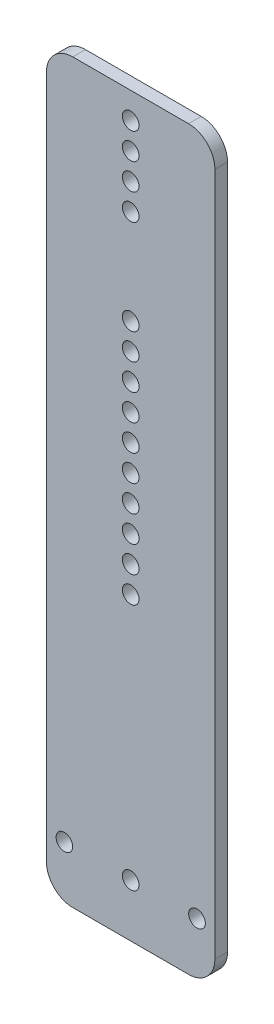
ISO-10303-21;
HEADER;
FILE_DESCRIPTION(('STEP AP214'),'2;1');
FILE_NAME('part.step','',(''),(''),'','','');
FILE_SCHEMA(('AUTOMOTIVE_DESIGN { 1 0 10303 214 1 1 1 1 }'));
ENDSEC;
DATA;
#1=APPLICATION_CONTEXT('core data for automotive mechanical design processes');
#2=APPLICATION_PROTOCOL_DEFINITION('international standard','automotive_design',2000,#1);
#3=PRODUCT_CONTEXT('',#1,'mechanical');
#4=PRODUCT('Part','Part','',(#3));
#5=PRODUCT_RELATED_PRODUCT_CATEGORY('part','',(#4));
#6=PRODUCT_DEFINITION_FORMATION('','',#4);
#7=PRODUCT_DEFINITION_CONTEXT('part definition',#1,'design');
#8=PRODUCT_DEFINITION('design','',#6,#7);
#9=PRODUCT_DEFINITION_SHAPE('','',#8);
#10=(LENGTH_UNIT() NAMED_UNIT(*) SI_UNIT(.MILLI.,.METRE.));
#11=(NAMED_UNIT(*) PLANE_ANGLE_UNIT() SI_UNIT($,.RADIAN.));
#12=(NAMED_UNIT(*) SI_UNIT($,.STERADIAN.) SOLID_ANGLE_UNIT());
#13=UNCERTAINTY_MEASURE_WITH_UNIT(LENGTH_MEASURE(1.E-05),#10,'distance_accuracy_value','');
#14=(GEOMETRIC_REPRESENTATION_CONTEXT(3) GLOBAL_UNCERTAINTY_ASSIGNED_CONTEXT((#13)) GLOBAL_UNIT_ASSIGNED_CONTEXT((#10,
#11,#12)) REPRESENTATION_CONTEXT('',''));
#15=CARTESIAN_POINT('',(0.,0.,0.));
#16=DIRECTION('',(0.,0.,1.));
#17=DIRECTION('',(1.,0.,0.));
#18=AXIS2_PLACEMENT_3D('',#15,#16,#17);
#19=CARTESIAN_POINT('',(20.32,88.9,3.048));
#20=DIRECTION('',(-1.,0.,0.));
#21=DIRECTION('',(0.,-1.,0.));
#22=AXIS2_PLACEMENT_3D('',#19,#20,#21);
#23=PLANE('',#22);
#24=DIRECTION('',(0.,1.,0.));
#25=VECTOR('',#24,1.);
#26=CARTESIAN_POINT('',(20.32,88.9,3.048));
#27=LINE('',#26,#25);
#28=CARTESIAN_POINT('',(20.32,-82.55,3.048));
#29=VERTEX_POINT('',#28);
#30=CARTESIAN_POINT('',(20.32,82.55,3.048));
#31=VERTEX_POINT('',#30);
#32=EDGE_CURVE('E119',#29,#31,#27,.T.);
#33=ORIENTED_EDGE('',*,*,#32,.F.);
#34=DIRECTION('',(0.,0.,-1.));
#35=VECTOR('',#34,1.);
#36=CARTESIAN_POINT('',(20.32,-82.55,3.048));
#37=LINE('',#36,#35);
#38=CARTESIAN_POINT('',(20.32,-82.55,0.));
#39=VERTEX_POINT('',#38);
#40=EDGE_CURVE('E104',#29,#39,#37,.T.);
#41=ORIENTED_EDGE('',*,*,#40,.T.);
#42=DIRECTION('',(0.,1.,0.));
#43=VECTOR('',#42,1.);
#44=CARTESIAN_POINT('',(20.32,88.9,0.));
#45=LINE('',#44,#43);
#46=CARTESIAN_POINT('',(20.32,82.55,0.));
#47=VERTEX_POINT('',#46);
#48=EDGE_CURVE('E116',#39,#47,#45,.T.);
#49=ORIENTED_EDGE('',*,*,#48,.T.);
#50=DIRECTION('',(0.,0.,-1.));
#51=VECTOR('',#50,1.);
#52=CARTESIAN_POINT('',(20.32,82.55,3.048));
#53=LINE('',#52,#51);
#54=EDGE_CURVE('E121',#47,#31,#53,.F.);
#55=ORIENTED_EDGE('',*,*,#54,.T.);
#56=EDGE_LOOP('',(#33,#41,#49,#55));
#57=FACE_BOUND('',#56,.T.);
#58=ADVANCED_FACE('F33',(#57),#23,.F.);
#59=CARTESIAN_POINT('',(-20.32,88.9,3.048));
#60=DIRECTION('',(0.,-1.,0.));
#61=DIRECTION('',(0.,0.,-1.));
#62=AXIS2_PLACEMENT_3D('',#59,#60,#61);
#63=PLANE('',#62);
#64=DIRECTION('',(-1.,0.,0.));
#65=VECTOR('',#64,1.);
#66=CARTESIAN_POINT('',(-20.32,88.9,3.048));
#67=LINE('',#66,#65);
#68=CARTESIAN_POINT('',(13.97,88.9,3.048));
#69=VERTEX_POINT('',#68);
#70=CARTESIAN_POINT('',(-13.97,88.9,3.048));
#71=VERTEX_POINT('',#70);
#72=EDGE_CURVE('E163',#69,#71,#67,.T.);
#73=ORIENTED_EDGE('',*,*,#72,.F.);
#74=DIRECTION('',(0.,0.,-1.));
#75=VECTOR('',#74,1.);
#76=CARTESIAN_POINT('',(13.97,88.9,3.048));
#77=LINE('',#76,#75);
#78=CARTESIAN_POINT('',(13.97,88.9,0.));
#79=VERTEX_POINT('',#78);
#80=EDGE_CURVE('E11',#69,#79,#77,.T.);
#81=ORIENTED_EDGE('',*,*,#80,.T.);
#82=DIRECTION('',(-1.,0.,0.));
#83=VECTOR('',#82,1.);
#84=CARTESIAN_POINT('',(-20.32,88.9,0.));
#85=LINE('',#84,#83);
#86=CARTESIAN_POINT('',(-13.97,88.9,0.));
#87=VERTEX_POINT('',#86);
#88=EDGE_CURVE('E126',#79,#87,#85,.T.);
#89=ORIENTED_EDGE('',*,*,#88,.T.);
#90=DIRECTION('',(0.,0.,-1.));
#91=VECTOR('',#90,1.);
#92=CARTESIAN_POINT('',(-13.97,88.9,3.048));
#93=LINE('',#92,#91);
#94=EDGE_CURVE('E41',#87,#71,#93,.F.);
#95=ORIENTED_EDGE('',*,*,#94,.T.);
#96=EDGE_LOOP('',(#73,#81,#89,#95));
#97=FACE_BOUND('',#96,.T.);
#98=ADVANCED_FACE('F162',(#97),#63,.F.);
#99=CARTESIAN_POINT('',(-20.32,88.9,3.048));
#100=DIRECTION('',(1.,0.,0.));
#101=DIRECTION('',(0.,1.,0.));
#102=AXIS2_PLACEMENT_3D('',#99,#100,#101);
#103=PLANE('',#102);
#104=DIRECTION('',(0.,-1.,0.));
#105=VECTOR('',#104,1.);
#106=CARTESIAN_POINT('',(-20.32,88.9,0.));
#107=LINE('',#106,#105);
#108=CARTESIAN_POINT('',(-20.32,82.55,0.));
#109=VERTEX_POINT('',#108);
#110=CARTESIAN_POINT('',(-20.32,-82.55,0.));
#111=VERTEX_POINT('',#110);
#112=EDGE_CURVE('E130',#109,#111,#107,.T.);
#113=ORIENTED_EDGE('',*,*,#112,.T.);
#114=DIRECTION('',(0.,0.,-1.));
#115=VECTOR('',#114,1.);
#116=CARTESIAN_POINT('',(-20.32,-82.55,3.048));
#117=LINE('',#116,#115);
#118=CARTESIAN_POINT('',(-20.32,-82.55,3.048));
#119=VERTEX_POINT('',#118);
#120=EDGE_CURVE('E48',#111,#119,#117,.F.);
#121=ORIENTED_EDGE('',*,*,#120,.T.);
#122=DIRECTION('',(0.,-1.,0.));
#123=VECTOR('',#122,1.);
#124=CARTESIAN_POINT('',(-20.32,88.9,3.048));
#125=LINE('',#124,#123);
#126=CARTESIAN_POINT('',(-20.32,82.55,3.048));
#127=VERTEX_POINT('',#126);
#128=EDGE_CURVE('E169',#127,#119,#125,.T.);
#129=ORIENTED_EDGE('',*,*,#128,.F.);
#130=DIRECTION('',(0.,0.,-1.));
#131=VECTOR('',#130,1.);
#132=CARTESIAN_POINT('',(-20.32,82.55,3.048));
#133=LINE('',#132,#131);
#134=EDGE_CURVE('E156',#127,#109,#133,.T.);
#135=ORIENTED_EDGE('',*,*,#134,.T.);
#136=EDGE_LOOP('',(#113,#121,#129,#135));
#137=FACE_BOUND('',#136,.T.);
#138=ADVANCED_FACE('F173',(#137),#103,.F.);
#139=CARTESIAN_POINT('',(-20.32,-88.9,3.048));
#140=DIRECTION('',(0.,1.,0.));
#141=DIRECTION('',(0.,0.,1.));
#142=AXIS2_PLACEMENT_3D('',#139,#140,#141);
#143=PLANE('',#142);
#144=DIRECTION('',(1.,0.,0.));
#145=VECTOR('',#144,1.);
#146=CARTESIAN_POINT('',(-20.32,-88.9,0.));
#147=LINE('',#146,#145);
#148=CARTESIAN_POINT('',(-13.97,-88.9,0.));
#149=VERTEX_POINT('',#148);
#150=CARTESIAN_POINT('',(13.97,-88.9,0.));
#151=VERTEX_POINT('',#150);
#152=EDGE_CURVE('E140',#149,#151,#147,.T.);
#153=ORIENTED_EDGE('',*,*,#152,.T.);
#154=DIRECTION('',(0.,0.,-1.));
#155=VECTOR('',#154,1.);
#156=CARTESIAN_POINT('',(13.97,-88.9,3.048));
#157=LINE('',#156,#155);
#158=CARTESIAN_POINT('',(13.97,-88.9,3.048));
#159=VERTEX_POINT('',#158);
#160=EDGE_CURVE('E105',#151,#159,#157,.F.);
#161=ORIENTED_EDGE('',*,*,#160,.T.);
#162=DIRECTION('',(1.,0.,0.));
#163=VECTOR('',#162,1.);
#164=CARTESIAN_POINT('',(-20.32,-88.9,3.048));
#165=LINE('',#164,#163);
#166=CARTESIAN_POINT('',(-13.97,-88.9,3.048));
#167=VERTEX_POINT('',#166);
#168=EDGE_CURVE('E136',#167,#159,#165,.T.);
#169=ORIENTED_EDGE('',*,*,#168,.F.);
#170=DIRECTION('',(0.,0.,-1.));
#171=VECTOR('',#170,1.);
#172=CARTESIAN_POINT('',(-13.97,-88.9,3.048));
#173=LINE('',#172,#171);
#174=EDGE_CURVE('E110',#167,#149,#173,.T.);
#175=ORIENTED_EDGE('',*,*,#174,.T.);
#176=EDGE_LOOP('',(#153,#161,#169,#175));
#177=FACE_BOUND('',#176,.T.);
#178=ADVANCED_FACE('F180',(#177),#143,.F.);
#179=CARTESIAN_POINT('',(0.,0.,3.048));
#180=DIRECTION('',(0.,0.,1.));
#181=DIRECTION('',(1.,0.,0.));
#182=AXIS2_PLACEMENT_3D('',#179,#180,#181);
#183=PLANE('',#182);
#184=CARTESIAN_POINT('',(0.,-16.4846,3.048));
#185=DIRECTION('',(0.,0.,1.));
#186=DIRECTION('',(1.,0.,0.));
#187=AXIS2_PLACEMENT_3D('',#184,#185,#186);
#188=CIRCLE('',#187,2.0193);
#189=CARTESIAN_POINT('',(2.0193,-16.4846,3.048));
#190=VERTEX_POINT('',#189);
#191=EDGE_CURVE('E276',#190,#190,#188,.T.);
#192=ORIENTED_EDGE('',*,*,#191,.F.);
#193=EDGE_LOOP('',(#192));
#194=FACE_BOUND('',#193,.T.);
#195=CARTESIAN_POINT('',(0.,-10.1346,3.048));
#196=DIRECTION('',(0.,0.,1.));
#197=DIRECTION('',(1.,0.,0.));
#198=AXIS2_PLACEMENT_3D('',#195,#196,#197);
#199=CIRCLE('',#198,2.0193);
#200=CARTESIAN_POINT('',(2.01929999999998,-10.1346,3.048));
#201=VERTEX_POINT('',#200);
#202=EDGE_CURVE('E270',#201,#201,#199,.T.);
#203=ORIENTED_EDGE('',*,*,#202,.F.);
#204=EDGE_LOOP('',(#203));
#205=FACE_BOUND('',#204,.T.);
#206=CARTESIAN_POINT('',(0.,-3.78459999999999,3.048));
#207=DIRECTION('',(0.,0.,1.));
#208=DIRECTION('',(1.,0.,0.));
#209=AXIS2_PLACEMENT_3D('',#206,#207,#208);
#210=CIRCLE('',#209,2.0193);
#211=CARTESIAN_POINT('',(2.01929999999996,-3.78459999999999,3.048));
#212=VERTEX_POINT('',#211);
#213=EDGE_CURVE('E264',#212,#212,#210,.T.);
#214=ORIENTED_EDGE('',*,*,#213,.F.);
#215=EDGE_LOOP('',(#214));
#216=FACE_BOUND('',#215,.T.);
#217=CARTESIAN_POINT('',(0.,2.56540000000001,3.048));
#218=DIRECTION('',(0.,0.,1.));
#219=DIRECTION('',(1.,0.,0.));
#220=AXIS2_PLACEMENT_3D('',#217,#218,#219);
#221=CIRCLE('',#220,2.0193);
#222=CARTESIAN_POINT('',(2.01929999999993,2.56540000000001,3.048));
#223=VERTEX_POINT('',#222);
#224=EDGE_CURVE('E258',#223,#223,#221,.T.);
#225=ORIENTED_EDGE('',*,*,#224,.F.);
#226=EDGE_LOOP('',(#225));
#227=FACE_BOUND('',#226,.T.);
#228=CARTESIAN_POINT('',(0.,8.91540000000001,3.048));
#229=DIRECTION('',(0.,0.,1.));
#230=DIRECTION('',(1.,0.,0.));
#231=AXIS2_PLACEMENT_3D('',#228,#229,#230);
#232=CIRCLE('',#231,2.0193);
#233=CARTESIAN_POINT('',(2.01929999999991,8.91540000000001,3.048));
#234=VERTEX_POINT('',#233);
#235=EDGE_CURVE('E252',#234,#234,#232,.T.);
#236=ORIENTED_EDGE('',*,*,#235,.F.);
#237=EDGE_LOOP('',(#236));
#238=FACE_BOUND('',#237,.T.);
#239=CARTESIAN_POINT('',(-1.10854532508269E-13,15.2654,3.048));
#240=DIRECTION('',(0.,0.,1.));
#241=DIRECTION('',(1.,0.,0.));
#242=AXIS2_PLACEMENT_3D('',#239,#240,#241);
#243=CIRCLE('',#242,2.0193);
#244=CARTESIAN_POINT('',(2.01929999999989,15.2654,3.048));
#245=VERTEX_POINT('',#244);
#246=EDGE_CURVE('E246',#245,#245,#243,.T.);
#247=ORIENTED_EDGE('',*,*,#246,.F.);
#248=EDGE_LOOP('',(#247));
#249=FACE_BOUND('',#248,.T.);
#250=CARTESIAN_POINT('',(-1.33025439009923E-13,21.6154,3.048));
#251=DIRECTION('',(0.,0.,1.));
#252=DIRECTION('',(1.,0.,0.));
#253=AXIS2_PLACEMENT_3D('',#250,#251,#252);
#254=CIRCLE('',#253,2.0193);
#255=CARTESIAN_POINT('',(2.01929999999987,21.6154,3.048));
#256=VERTEX_POINT('',#255);
#257=EDGE_CURVE('E240',#256,#256,#254,.T.);
#258=ORIENTED_EDGE('',*,*,#257,.F.);
#259=EDGE_LOOP('',(#258));
#260=FACE_BOUND('',#259,.T.);
#261=CARTESIAN_POINT('',(-1.55196345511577E-13,27.9654,3.048));
#262=DIRECTION('',(0.,0.,1.));
#263=DIRECTION('',(1.,0.,0.));
#264=AXIS2_PLACEMENT_3D('',#261,#262,#263);
#265=CIRCLE('',#264,2.0193);
#266=CARTESIAN_POINT('',(2.01929999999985,27.9654,3.048));
#267=VERTEX_POINT('',#266);
#268=EDGE_CURVE('E234',#267,#267,#265,.T.);
#269=ORIENTED_EDGE('',*,*,#268,.F.);
#270=EDGE_LOOP('',(#269));
#271=FACE_BOUND('',#270,.T.);
#272=CARTESIAN_POINT('',(-1.77367252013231E-13,34.3154,3.048));
#273=DIRECTION('',(0.,0.,1.));
#274=DIRECTION('',(1.,0.,0.));
#275=AXIS2_PLACEMENT_3D('',#272,#273,#274);
#276=CIRCLE('',#275,2.0193);
#277=CARTESIAN_POINT('',(2.01929999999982,34.3154,3.048));
#278=VERTEX_POINT('',#277);
#279=EDGE_CURVE('E228',#278,#278,#276,.T.);
#280=ORIENTED_EDGE('',*,*,#279,.F.);
#281=EDGE_LOOP('',(#280));
#282=FACE_BOUND('',#281,.T.);
#283=CARTESIAN_POINT('',(-1.99538158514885E-13,40.6654,3.048));
#284=DIRECTION('',(0.,0.,1.));
#285=DIRECTION('',(1.,0.,0.));
#286=AXIS2_PLACEMENT_3D('',#283,#284,#285);
#287=CIRCLE('',#286,2.0193);
#288=CARTESIAN_POINT('',(2.0192999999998,40.6654,3.048));
#289=VERTEX_POINT('',#288);
#290=EDGE_CURVE('E222',#289,#289,#287,.T.);
#291=ORIENTED_EDGE('',*,*,#290,.F.);
#292=EDGE_LOOP('',(#291));
#293=FACE_BOUND('',#292,.T.);
#294=CARTESIAN_POINT('',(-16.002,-76.2000000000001,3.048));
#295=DIRECTION('',(0.,0.,1.));
#296=DIRECTION('',(1.,0.,0.));
#297=AXIS2_PLACEMENT_3D('',#294,#295,#296);
#298=CIRCLE('',#297,2.0066);
#299=CARTESIAN_POINT('',(-13.9954,-76.2000000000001,3.048));
#300=VERTEX_POINT('',#299);
#301=EDGE_CURVE('E186',#300,#300,#298,.T.);
#302=ORIENTED_EDGE('',*,*,#301,.F.);
#303=EDGE_LOOP('',(#302));
#304=FACE_BOUND('',#303,.T.);
#305=CARTESIAN_POINT('',(16.002,-76.2,3.048));
#306=DIRECTION('',(0.,0.,1.));
#307=DIRECTION('',(1.,0.,0.));
#308=AXIS2_PLACEMENT_3D('',#305,#306,#307);
#309=CIRCLE('',#308,2.0066);
#310=CARTESIAN_POINT('',(18.0086,-76.2,3.048));
#311=VERTEX_POINT('',#310);
#312=EDGE_CURVE('E193',#311,#311,#309,.T.);
#313=ORIENTED_EDGE('',*,*,#312,.F.);
#314=EDGE_LOOP('',(#313));
#315=FACE_BOUND('',#314,.T.);
#316=CARTESIAN_POINT('',(1.99538158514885E-13,63.5,3.048));
#317=DIRECTION('',(0.,0.,1.));
#318=DIRECTION('',(1.,0.,0.));
#319=AXIS2_PLACEMENT_3D('',#316,#317,#318);
#320=CIRCLE('',#319,2.0066);
#321=CARTESIAN_POINT('',(2.0066000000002,63.5,3.048));
#322=VERTEX_POINT('',#321);
#323=EDGE_CURVE('E199',#322,#322,#320,.T.);
#324=ORIENTED_EDGE('',*,*,#323,.F.);
#325=EDGE_LOOP('',(#324));
#326=FACE_BOUND('',#325,.T.);
#327=CARTESIAN_POINT('',(1.33025439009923E-13,69.85,3.048));
#328=DIRECTION('',(0.,0.,1.));
#329=DIRECTION('',(1.,0.,0.));
#330=AXIS2_PLACEMENT_3D('',#327,#328,#329);
#331=CIRCLE('',#330,2.0066);
#332=CARTESIAN_POINT('',(2.00660000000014,69.85,3.048));
#333=VERTEX_POINT('',#332);
#334=EDGE_CURVE('E205',#333,#333,#331,.T.);
#335=ORIENTED_EDGE('',*,*,#334,.F.);
#336=EDGE_LOOP('',(#335));
#337=FACE_BOUND('',#336,.T.);
#338=CARTESIAN_POINT('',(0.,76.2,3.048));
#339=DIRECTION('',(0.,0.,1.));
#340=DIRECTION('',(1.,0.,0.));
#341=AXIS2_PLACEMENT_3D('',#338,#339,#340);
#342=CIRCLE('',#341,2.0066);
#343=CARTESIAN_POINT('',(2.00660000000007,76.2,3.048));
#344=VERTEX_POINT('',#343);
#345=EDGE_CURVE('E211',#344,#344,#342,.T.);
#346=ORIENTED_EDGE('',*,*,#345,.F.);
#347=EDGE_LOOP('',(#346));
#348=FACE_BOUND('',#347,.T.);
#349=CARTESIAN_POINT('',(0.,82.55,3.048));
#350=DIRECTION('',(0.,0.,1.));
#351=DIRECTION('',(1.,0.,0.));
#352=AXIS2_PLACEMENT_3D('',#349,#350,#351);
#353=CIRCLE('',#352,2.0066);
#354=CARTESIAN_POINT('',(2.0066,82.55,3.048));
#355=VERTEX_POINT('',#354);
#356=EDGE_CURVE('E217',#355,#355,#353,.T.);
#357=ORIENTED_EDGE('',*,*,#356,.F.);
#358=EDGE_LOOP('',(#357));
#359=FACE_BOUND('',#358,.T.);
#360=CARTESIAN_POINT('',(0.,-76.2,3.048));
#361=DIRECTION('',(0.,0.,1.));
#362=DIRECTION('',(1.,0.,0.));
#363=AXIS2_PLACEMENT_3D('',#360,#361,#362);
#364=CIRCLE('',#363,2.0066);
#365=CARTESIAN_POINT('',(2.0066,-76.2,3.048));
#366=VERTEX_POINT('',#365);
#367=EDGE_CURVE('E133',#366,#366,#364,.T.);
#368=ORIENTED_EDGE('',*,*,#367,.F.);
#369=EDGE_LOOP('',(#368));
#370=FACE_BOUND('',#369,.T.);
#371=ORIENTED_EDGE('',*,*,#168,.T.);
#372=CARTESIAN_POINT('',(13.97,-82.55,3.048));
#373=DIRECTION('',(0.,0.,1.));
#374=DIRECTION('',(1.,0.,0.));
#375=AXIS2_PLACEMENT_3D('',#372,#373,#374);
#376=CIRCLE('',#375,6.35);
#377=EDGE_CURVE('E154',#159,#29,#376,.T.);
#378=ORIENTED_EDGE('',*,*,#377,.T.);
#379=ORIENTED_EDGE('',*,*,#32,.T.);
#380=CARTESIAN_POINT('',(13.97,82.55,3.048));
#381=DIRECTION('',(0.,0.,1.));
#382=DIRECTION('',(1.,0.,0.));
#383=AXIS2_PLACEMENT_3D('',#380,#381,#382);
#384=CIRCLE('',#383,6.35);
#385=EDGE_CURVE('E150',#31,#69,#384,.T.);
#386=ORIENTED_EDGE('',*,*,#385,.T.);
#387=ORIENTED_EDGE('',*,*,#72,.T.);
#388=CARTESIAN_POINT('',(-13.97,82.55,3.048));
#389=DIRECTION('',(0.,0.,1.));
#390=DIRECTION('',(1.,0.,0.));
#391=AXIS2_PLACEMENT_3D('',#388,#389,#390);
#392=CIRCLE('',#391,6.35);
#393=EDGE_CURVE('E55',#71,#127,#392,.T.);
#394=ORIENTED_EDGE('',*,*,#393,.T.);
#395=ORIENTED_EDGE('',*,*,#128,.T.);
#396=CARTESIAN_POINT('',(-13.97,-82.55,3.048));
#397=DIRECTION('',(0.,0.,1.));
#398=DIRECTION('',(1.,0.,0.));
#399=AXIS2_PLACEMENT_3D('',#396,#397,#398);
#400=CIRCLE('',#399,6.35);
#401=EDGE_CURVE('E152',#119,#167,#400,.T.);
#402=ORIENTED_EDGE('',*,*,#401,.T.);
#403=EDGE_LOOP('',(#371,#378,#379,#386,#387,#394,#395,#402));
#404=FACE_BOUND('',#403,.T.);
#405=ADVANCED_FACE('F167',(#194,#205,#216,#227,#238,#249,#260,#271,#282,#293,#304,#315,#326,
#337,#348,#359,#370,#404),#183,.T.);
#406=CARTESIAN_POINT('',(0.,0.,0.));
#407=DIRECTION('',(0.,0.,1.));
#408=DIRECTION('',(1.,0.,0.));
#409=AXIS2_PLACEMENT_3D('',#406,#407,#408);
#410=PLANE('',#409);
#411=CARTESIAN_POINT('',(0.,-16.4846,0.));
#412=DIRECTION('',(0.,0.,1.));
#413=DIRECTION('',(1.,0.,0.));
#414=AXIS2_PLACEMENT_3D('',#411,#412,#413);
#415=CIRCLE('',#414,2.0193);
#416=CARTESIAN_POINT('',(2.0193,-16.4846,0.));
#417=VERTEX_POINT('',#416);
#418=EDGE_CURVE('E190',#417,#417,#415,.T.);
#419=ORIENTED_EDGE('',*,*,#418,.T.);
#420=EDGE_LOOP('',(#419));
#421=FACE_BOUND('',#420,.T.);
#422=CARTESIAN_POINT('',(0.,-10.1346,0.));
#423=DIRECTION('',(0.,0.,1.));
#424=DIRECTION('',(1.,0.,0.));
#425=AXIS2_PLACEMENT_3D('',#422,#423,#424);
#426=CIRCLE('',#425,2.0193);
#427=CARTESIAN_POINT('',(2.01929999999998,-10.1346,0.));
#428=VERTEX_POINT('',#427);
#429=EDGE_CURVE('E273',#428,#428,#426,.T.);
#430=ORIENTED_EDGE('',*,*,#429,.T.);
#431=EDGE_LOOP('',(#430));
#432=FACE_BOUND('',#431,.T.);
#433=CARTESIAN_POINT('',(0.,-3.78459999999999,0.));
#434=DIRECTION('',(0.,0.,1.));
#435=DIRECTION('',(1.,0.,0.));
#436=AXIS2_PLACEMENT_3D('',#433,#434,#435);
#437=CIRCLE('',#436,2.0193);
#438=CARTESIAN_POINT('',(2.01929999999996,-3.78459999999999,0.));
#439=VERTEX_POINT('',#438);
#440=EDGE_CURVE('E267',#439,#439,#437,.T.);
#441=ORIENTED_EDGE('',*,*,#440,.T.);
#442=EDGE_LOOP('',(#441));
#443=FACE_BOUND('',#442,.T.);
#444=CARTESIAN_POINT('',(0.,2.56540000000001,0.));
#445=DIRECTION('',(0.,0.,1.));
#446=DIRECTION('',(1.,0.,0.));
#447=AXIS2_PLACEMENT_3D('',#444,#445,#446);
#448=CIRCLE('',#447,2.0193);
#449=CARTESIAN_POINT('',(2.01929999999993,2.56540000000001,0.));
#450=VERTEX_POINT('',#449);
#451=EDGE_CURVE('E261',#450,#450,#448,.T.);
#452=ORIENTED_EDGE('',*,*,#451,.T.);
#453=EDGE_LOOP('',(#452));
#454=FACE_BOUND('',#453,.T.);
#455=CARTESIAN_POINT('',(0.,8.91540000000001,0.));
#456=DIRECTION('',(0.,0.,1.));
#457=DIRECTION('',(1.,0.,0.));
#458=AXIS2_PLACEMENT_3D('',#455,#456,#457);
#459=CIRCLE('',#458,2.0193);
#460=CARTESIAN_POINT('',(2.01929999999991,8.91540000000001,0.));
#461=VERTEX_POINT('',#460);
#462=EDGE_CURVE('E255',#461,#461,#459,.T.);
#463=ORIENTED_EDGE('',*,*,#462,.T.);
#464=EDGE_LOOP('',(#463));
#465=FACE_BOUND('',#464,.T.);
#466=CARTESIAN_POINT('',(-1.10854532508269E-13,15.2654,0.));
#467=DIRECTION('',(0.,0.,1.));
#468=DIRECTION('',(1.,0.,0.));
#469=AXIS2_PLACEMENT_3D('',#466,#467,#468);
#470=CIRCLE('',#469,2.0193);
#471=CARTESIAN_POINT('',(2.01929999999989,15.2654,0.));
#472=VERTEX_POINT('',#471);
#473=EDGE_CURVE('E249',#472,#472,#470,.T.);
#474=ORIENTED_EDGE('',*,*,#473,.T.);
#475=EDGE_LOOP('',(#474));
#476=FACE_BOUND('',#475,.T.);
#477=CARTESIAN_POINT('',(-1.33025439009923E-13,21.6154,0.));
#478=DIRECTION('',(0.,0.,1.));
#479=DIRECTION('',(1.,0.,0.));
#480=AXIS2_PLACEMENT_3D('',#477,#478,#479);
#481=CIRCLE('',#480,2.0193);
#482=CARTESIAN_POINT('',(2.01929999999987,21.6154,0.));
#483=VERTEX_POINT('',#482);
#484=EDGE_CURVE('E243',#483,#483,#481,.T.);
#485=ORIENTED_EDGE('',*,*,#484,.T.);
#486=EDGE_LOOP('',(#485));
#487=FACE_BOUND('',#486,.T.);
#488=CARTESIAN_POINT('',(-1.55196345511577E-13,27.9654,0.));
#489=DIRECTION('',(0.,0.,1.));
#490=DIRECTION('',(1.,0.,0.));
#491=AXIS2_PLACEMENT_3D('',#488,#489,#490);
#492=CIRCLE('',#491,2.0193);
#493=CARTESIAN_POINT('',(2.01929999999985,27.9654,0.));
#494=VERTEX_POINT('',#493);
#495=EDGE_CURVE('E237',#494,#494,#492,.T.);
#496=ORIENTED_EDGE('',*,*,#495,.T.);
#497=EDGE_LOOP('',(#496));
#498=FACE_BOUND('',#497,.T.);
#499=CARTESIAN_POINT('',(-1.77367252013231E-13,34.3154,0.));
#500=DIRECTION('',(0.,0.,1.));
#501=DIRECTION('',(1.,0.,0.));
#502=AXIS2_PLACEMENT_3D('',#499,#500,#501);
#503=CIRCLE('',#502,2.0193);
#504=CARTESIAN_POINT('',(2.01929999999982,34.3154,0.));
#505=VERTEX_POINT('',#504);
#506=EDGE_CURVE('E231',#505,#505,#503,.T.);
#507=ORIENTED_EDGE('',*,*,#506,.T.);
#508=EDGE_LOOP('',(#507));
#509=FACE_BOUND('',#508,.T.);
#510=CARTESIAN_POINT('',(-1.99538158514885E-13,40.6654,0.));
#511=DIRECTION('',(0.,0.,1.));
#512=DIRECTION('',(1.,0.,0.));
#513=AXIS2_PLACEMENT_3D('',#510,#511,#512);
#514=CIRCLE('',#513,2.0193);
#515=CARTESIAN_POINT('',(2.0192999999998,40.6654,0.));
#516=VERTEX_POINT('',#515);
#517=EDGE_CURVE('E225',#516,#516,#514,.T.);
#518=ORIENTED_EDGE('',*,*,#517,.T.);
#519=EDGE_LOOP('',(#518));
#520=FACE_BOUND('',#519,.T.);
#521=CARTESIAN_POINT('',(-16.002,-76.2000000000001,0.));
#522=DIRECTION('',(0.,0.,1.));
#523=DIRECTION('',(1.,0.,0.));
#524=AXIS2_PLACEMENT_3D('',#521,#522,#523);
#525=CIRCLE('',#524,2.0066);
#526=CARTESIAN_POINT('',(-13.9954,-76.2000000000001,0.));
#527=VERTEX_POINT('',#526);
#528=EDGE_CURVE('E189',#527,#527,#525,.T.);
#529=ORIENTED_EDGE('',*,*,#528,.T.);
#530=EDGE_LOOP('',(#529));
#531=FACE_BOUND('',#530,.T.);
#532=CARTESIAN_POINT('',(16.002,-76.2,0.));
#533=DIRECTION('',(0.,0.,1.));
#534=DIRECTION('',(1.,0.,0.));
#535=AXIS2_PLACEMENT_3D('',#532,#533,#534);
#536=CIRCLE('',#535,2.0066);
#537=CARTESIAN_POINT('',(18.0086,-76.2,0.));
#538=VERTEX_POINT('',#537);
#539=EDGE_CURVE('E196',#538,#538,#536,.T.);
#540=ORIENTED_EDGE('',*,*,#539,.T.);
#541=EDGE_LOOP('',(#540));
#542=FACE_BOUND('',#541,.T.);
#543=CARTESIAN_POINT('',(1.99538158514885E-13,63.5,0.));
#544=DIRECTION('',(0.,0.,1.));
#545=DIRECTION('',(1.,0.,0.));
#546=AXIS2_PLACEMENT_3D('',#543,#544,#545);
#547=CIRCLE('',#546,2.0066);
#548=CARTESIAN_POINT('',(2.0066000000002,63.5,0.));
#549=VERTEX_POINT('',#548);
#550=EDGE_CURVE('E202',#549,#549,#547,.T.);
#551=ORIENTED_EDGE('',*,*,#550,.T.);
#552=EDGE_LOOP('',(#551));
#553=FACE_BOUND('',#552,.T.);
#554=CARTESIAN_POINT('',(1.33025439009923E-13,69.85,0.));
#555=DIRECTION('',(0.,0.,1.));
#556=DIRECTION('',(1.,0.,0.));
#557=AXIS2_PLACEMENT_3D('',#554,#555,#556);
#558=CIRCLE('',#557,2.0066);
#559=CARTESIAN_POINT('',(2.00660000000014,69.85,0.));
#560=VERTEX_POINT('',#559);
#561=EDGE_CURVE('E208',#560,#560,#558,.T.);
#562=ORIENTED_EDGE('',*,*,#561,.T.);
#563=EDGE_LOOP('',(#562));
#564=FACE_BOUND('',#563,.T.);
#565=CARTESIAN_POINT('',(0.,76.2,0.));
#566=DIRECTION('',(0.,0.,1.));
#567=DIRECTION('',(1.,0.,0.));
#568=AXIS2_PLACEMENT_3D('',#565,#566,#567);
#569=CIRCLE('',#568,2.0066);
#570=CARTESIAN_POINT('',(2.00660000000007,76.2,0.));
#571=VERTEX_POINT('',#570);
#572=EDGE_CURVE('E214',#571,#571,#569,.T.);
#573=ORIENTED_EDGE('',*,*,#572,.T.);
#574=EDGE_LOOP('',(#573));
#575=FACE_BOUND('',#574,.T.);
#576=CARTESIAN_POINT('',(0.,82.55,0.));
#577=DIRECTION('',(0.,0.,1.));
#578=DIRECTION('',(1.,0.,0.));
#579=AXIS2_PLACEMENT_3D('',#576,#577,#578);
#580=CIRCLE('',#579,2.0066);
#581=CARTESIAN_POINT('',(2.0066,82.55,0.));
#582=VERTEX_POINT('',#581);
#583=EDGE_CURVE('E184',#582,#582,#580,.T.);
#584=ORIENTED_EDGE('',*,*,#583,.T.);
#585=EDGE_LOOP('',(#584));
#586=FACE_BOUND('',#585,.T.);
#587=CARTESIAN_POINT('',(0.,-76.2,0.));
#588=DIRECTION('',(0.,0.,1.));
#589=DIRECTION('',(1.,0.,0.));
#590=AXIS2_PLACEMENT_3D('',#587,#588,#589);
#591=CIRCLE('',#590,2.0066);
#592=CARTESIAN_POINT('',(2.0066,-76.2,0.));
#593=VERTEX_POINT('',#592);
#594=EDGE_CURVE('E127',#593,#593,#591,.T.);
#595=ORIENTED_EDGE('',*,*,#594,.T.);
#596=EDGE_LOOP('',(#595));
#597=FACE_BOUND('',#596,.T.);
#598=ORIENTED_EDGE('',*,*,#48,.F.);
#599=CARTESIAN_POINT('',(13.97,-82.55,0.));
#600=DIRECTION('',(0.,0.,1.));
#601=DIRECTION('',(1.,0.,0.));
#602=AXIS2_PLACEMENT_3D('',#599,#600,#601);
#603=CIRCLE('',#602,6.35);
#604=EDGE_CURVE('E100',#39,#151,#603,.F.);
#605=ORIENTED_EDGE('',*,*,#604,.T.);
#606=ORIENTED_EDGE('',*,*,#152,.F.);
#607=CARTESIAN_POINT('',(-13.97,-82.55,0.));
#608=DIRECTION('',(0.,0.,1.));
#609=DIRECTION('',(1.,0.,0.));
#610=AXIS2_PLACEMENT_3D('',#607,#608,#609);
#611=CIRCLE('',#610,6.35);
#612=EDGE_CURVE('E111',#149,#111,#611,.F.);
#613=ORIENTED_EDGE('',*,*,#612,.T.);
#614=ORIENTED_EDGE('',*,*,#112,.F.);
#615=CARTESIAN_POINT('',(-13.97,82.55,0.));
#616=DIRECTION('',(0.,0.,1.));
#617=DIRECTION('',(1.,0.,0.));
#618=AXIS2_PLACEMENT_3D('',#615,#616,#617);
#619=CIRCLE('',#618,6.35);
#620=EDGE_CURVE('E120',#109,#87,#619,.F.);
#621=ORIENTED_EDGE('',*,*,#620,.T.);
#622=ORIENTED_EDGE('',*,*,#88,.F.);
#623=CARTESIAN_POINT('',(13.97,82.55,0.));
#624=DIRECTION('',(0.,0.,1.));
#625=DIRECTION('',(1.,0.,0.));
#626=AXIS2_PLACEMENT_3D('',#623,#624,#625);
#627=CIRCLE('',#626,6.35);
#628=EDGE_CURVE('E125',#79,#47,#627,.F.);
#629=ORIENTED_EDGE('',*,*,#628,.T.);
#630=EDGE_LOOP('',(#598,#605,#606,#613,#614,#621,#622,#629));
#631=FACE_BOUND('',#630,.T.);
#632=ADVANCED_FACE('F123',(#421,#432,#443,#454,#465,#476,#487,#498,#509,#520,#531,#542,#553,
#564,#575,#586,#597,#631),#410,.F.);
#633=CARTESIAN_POINT('',(0.,-76.2,0.));
#634=DIRECTION('',(0.,0.,1.));
#635=DIRECTION('',(1.,0.,0.));
#636=AXIS2_PLACEMENT_3D('',#633,#634,#635);
#637=CYLINDRICAL_SURFACE('',#636,2.0066);
#638=CARTESIAN_POINT('',(2.0066,-76.2,0.));
#639=CARTESIAN_POINT('',(2.0066,-76.2,0.03175));
#640=CARTESIAN_POINT('',(2.0066,-76.2,0.0635));
#641=CARTESIAN_POINT('',(2.0066,-76.2,0.127));
#642=CARTESIAN_POINT('',(2.0066,-76.2,0.15875));
#643=CARTESIAN_POINT('',(2.0066,-76.2,0.22225));
#644=CARTESIAN_POINT('',(2.0066,-76.2,0.254));
#645=CARTESIAN_POINT('',(2.0066,-76.2,0.3175));
#646=CARTESIAN_POINT('',(2.0066,-76.2,0.34925));
#647=CARTESIAN_POINT('',(2.0066,-76.2,0.41275));
#648=CARTESIAN_POINT('',(2.0066,-76.2,0.4445));
#649=CARTESIAN_POINT('',(2.0066,-76.2,0.508));
#650=CARTESIAN_POINT('',(2.0066,-76.2,0.53975));
#651=CARTESIAN_POINT('',(2.0066,-76.2,0.60325));
#652=CARTESIAN_POINT('',(2.0066,-76.2,0.635));
#653=CARTESIAN_POINT('',(2.0066,-76.2,0.6985));
#654=CARTESIAN_POINT('',(2.0066,-76.2,0.73025));
#655=CARTESIAN_POINT('',(2.0066,-76.2,0.79375));
#656=CARTESIAN_POINT('',(2.0066,-76.2,0.8255));
#657=CARTESIAN_POINT('',(2.0066,-76.2,0.889));
#658=CARTESIAN_POINT('',(2.0066,-76.2,0.92075));
#659=CARTESIAN_POINT('',(2.0066,-76.2,0.98425));
#660=CARTESIAN_POINT('',(2.0066,-76.2,1.016));
#661=CARTESIAN_POINT('',(2.0066,-76.2,1.0795));
#662=CARTESIAN_POINT('',(2.0066,-76.2,1.11125));
#663=CARTESIAN_POINT('',(2.0066,-76.2,1.17475));
#664=CARTESIAN_POINT('',(2.0066,-76.2,1.2065));
#665=CARTESIAN_POINT('',(2.0066,-76.2,1.27));
#666=CARTESIAN_POINT('',(2.0066,-76.2,1.30175));
#667=CARTESIAN_POINT('',(2.0066,-76.2,1.36525));
#668=CARTESIAN_POINT('',(2.0066,-76.2,1.397));
#669=CARTESIAN_POINT('',(2.0066,-76.2,1.4605));
#670=CARTESIAN_POINT('',(2.0066,-76.2,1.49225));
#671=CARTESIAN_POINT('',(2.0066,-76.2,1.55575));
#672=CARTESIAN_POINT('',(2.0066,-76.2,1.5875));
#673=CARTESIAN_POINT('',(2.0066,-76.2,1.651));
#674=CARTESIAN_POINT('',(2.0066,-76.2,1.68275));
#675=CARTESIAN_POINT('',(2.0066,-76.2,1.74625));
#676=CARTESIAN_POINT('',(2.0066,-76.2,1.778));
#677=CARTESIAN_POINT('',(2.0066,-76.2,1.8415));
#678=CARTESIAN_POINT('',(2.0066,-76.2,1.87325));
#679=CARTESIAN_POINT('',(2.0066,-76.2,1.93675));
#680=CARTESIAN_POINT('',(2.0066,-76.2,1.9685));
#681=CARTESIAN_POINT('',(2.0066,-76.2,2.032));
#682=CARTESIAN_POINT('',(2.0066,-76.2,2.06375));
#683=CARTESIAN_POINT('',(2.0066,-76.2,2.12725));
#684=CARTESIAN_POINT('',(2.0066,-76.2,2.159));
#685=CARTESIAN_POINT('',(2.0066,-76.2,2.2225));
#686=CARTESIAN_POINT('',(2.0066,-76.2,2.25425));
#687=CARTESIAN_POINT('',(2.0066,-76.2,2.31775));
#688=CARTESIAN_POINT('',(2.0066,-76.2,2.3495));
#689=CARTESIAN_POINT('',(2.0066,-76.2,2.413));
#690=CARTESIAN_POINT('',(2.0066,-76.2,2.44475));
#691=CARTESIAN_POINT('',(2.0066,-76.2,2.50825));
#692=CARTESIAN_POINT('',(2.0066,-76.2,2.54));
#693=CARTESIAN_POINT('',(2.0066,-76.2,2.6035));
#694=CARTESIAN_POINT('',(2.0066,-76.2,2.63525));
#695=CARTESIAN_POINT('',(2.0066,-76.2,2.69875));
#696=CARTESIAN_POINT('',(2.0066,-76.2,2.7305));
#697=CARTESIAN_POINT('',(2.0066,-76.2,2.794));
#698=CARTESIAN_POINT('',(2.0066,-76.2,2.82575));
#699=CARTESIAN_POINT('',(2.0066,-76.2,2.88925));
#700=CARTESIAN_POINT('',(2.0066,-76.2,2.921));
#701=CARTESIAN_POINT('',(2.0066,-76.2,2.9845));
#702=CARTESIAN_POINT('',(2.0066,-76.2,3.01625));
#703=CARTESIAN_POINT('',(2.0066,-76.2,3.048));
#704=B_SPLINE_CURVE_WITH_KNOTS('',3,(#638,#639,#640,#641,#642,#643,#644,#645,#646,#647,#648,
#649,#650,#651,#652,#653,#654,#655,#656,#657,#658,#659,#660,#661,#662,#663,#664,#665,#666,#667,
#668,#669,#670,#671,#672,#673,#674,#675,#676,#677,#678,#679,#680,#681,#682,#683,#684,#685,#686,
#687,#688,#689,#690,#691,#692,#693,#694,#695,#696,#697,#698,#699,#700,#701,#702,#703),
.UNSPECIFIED.,.F.,.F.,(4,2,2,2,2,2,2,2,2,2,2,2,2,2,2,2,2,2,2,2,2,2,2,2,2,2,2,2,2,2,2,2,4),(0.,
0.09525,0.1905,0.28575,0.381,0.47625,0.5715,0.66675,0.762,0.85725,0.9525,1.04775,1.143,1.23825,
1.3335,1.42875,1.524,1.61925,1.7145,1.80975,1.905,2.00025,2.0955,2.19075,2.286,2.38125,2.4765,
2.57175,2.667,2.76225,2.8575,2.95275,3.048),.UNSPECIFIED.);
#705=EDGE_CURVE('BSEAM326',#593,#366,#704,.T.);
#706=ORIENTED_EDGE('',*,*,#594,.F.);
#707=ORIENTED_EDGE('',*,*,#367,.T.);
#708=ORIENTED_EDGE('',*,*,#705,.T.);
#709=ORIENTED_EDGE('',*,*,#705,.F.);
#710=EDGE_LOOP('',(#706,#708,#707,#709));
#711=FACE_BOUND('',#710,.T.);
#712=ADVANCED_FACE('F326',(#711),#637,.F.);
#713=CARTESIAN_POINT('',(0.,82.55,0.));
#714=DIRECTION('',(0.,0.,1.));
#715=DIRECTION('',(1.,0.,0.));
#716=AXIS2_PLACEMENT_3D('',#713,#714,#715);
#717=CYLINDRICAL_SURFACE('',#716,2.0066);
#718=CARTESIAN_POINT('',(2.0066,82.55,0.));
#719=CARTESIAN_POINT('',(2.0066,82.55,0.03175));
#720=CARTESIAN_POINT('',(2.0066,82.55,0.0635));
#721=CARTESIAN_POINT('',(2.0066,82.55,0.127));
#722=CARTESIAN_POINT('',(2.0066,82.55,0.15875));
#723=CARTESIAN_POINT('',(2.0066,82.55,0.22225));
#724=CARTESIAN_POINT('',(2.0066,82.55,0.254));
#725=CARTESIAN_POINT('',(2.0066,82.55,0.3175));
#726=CARTESIAN_POINT('',(2.0066,82.55,0.34925));
#727=CARTESIAN_POINT('',(2.0066,82.55,0.41275));
#728=CARTESIAN_POINT('',(2.0066,82.55,0.4445));
#729=CARTESIAN_POINT('',(2.0066,82.55,0.508));
#730=CARTESIAN_POINT('',(2.0066,82.55,0.53975));
#731=CARTESIAN_POINT('',(2.0066,82.55,0.60325));
#732=CARTESIAN_POINT('',(2.0066,82.55,0.635));
#733=CARTESIAN_POINT('',(2.0066,82.55,0.6985));
#734=CARTESIAN_POINT('',(2.0066,82.55,0.73025));
#735=CARTESIAN_POINT('',(2.0066,82.55,0.79375));
#736=CARTESIAN_POINT('',(2.0066,82.55,0.8255));
#737=CARTESIAN_POINT('',(2.0066,82.55,0.889));
#738=CARTESIAN_POINT('',(2.0066,82.55,0.92075));
#739=CARTESIAN_POINT('',(2.0066,82.55,0.98425));
#740=CARTESIAN_POINT('',(2.0066,82.55,1.016));
#741=CARTESIAN_POINT('',(2.0066,82.55,1.0795));
#742=CARTESIAN_POINT('',(2.0066,82.55,1.11125));
#743=CARTESIAN_POINT('',(2.0066,82.55,1.17475));
#744=CARTESIAN_POINT('',(2.0066,82.55,1.2065));
#745=CARTESIAN_POINT('',(2.0066,82.55,1.27));
#746=CARTESIAN_POINT('',(2.0066,82.55,1.30175));
#747=CARTESIAN_POINT('',(2.0066,82.55,1.36525));
#748=CARTESIAN_POINT('',(2.0066,82.55,1.397));
#749=CARTESIAN_POINT('',(2.0066,82.55,1.4605));
#750=CARTESIAN_POINT('',(2.0066,82.55,1.49225));
#751=CARTESIAN_POINT('',(2.0066,82.55,1.55575));
#752=CARTESIAN_POINT('',(2.0066,82.55,1.5875));
#753=CARTESIAN_POINT('',(2.0066,82.55,1.651));
#754=CARTESIAN_POINT('',(2.0066,82.55,1.68275));
#755=CARTESIAN_POINT('',(2.0066,82.55,1.74625));
#756=CARTESIAN_POINT('',(2.0066,82.55,1.778));
#757=CARTESIAN_POINT('',(2.0066,82.55,1.8415));
#758=CARTESIAN_POINT('',(2.0066,82.55,1.87325));
#759=CARTESIAN_POINT('',(2.0066,82.55,1.93675));
#760=CARTESIAN_POINT('',(2.0066,82.55,1.9685));
#761=CARTESIAN_POINT('',(2.0066,82.55,2.032));
#762=CARTESIAN_POINT('',(2.0066,82.55,2.06375));
#763=CARTESIAN_POINT('',(2.0066,82.55,2.12725));
#764=CARTESIAN_POINT('',(2.0066,82.55,2.159));
#765=CARTESIAN_POINT('',(2.0066,82.55,2.2225));
#766=CARTESIAN_POINT('',(2.0066,82.55,2.25425));
#767=CARTESIAN_POINT('',(2.0066,82.55,2.31775));
#768=CARTESIAN_POINT('',(2.0066,82.55,2.3495));
#769=CARTESIAN_POINT('',(2.0066,82.55,2.413));
#770=CARTESIAN_POINT('',(2.0066,82.55,2.44475));
#771=CARTESIAN_POINT('',(2.0066,82.55,2.50825));
#772=CARTESIAN_POINT('',(2.0066,82.55,2.54));
#773=CARTESIAN_POINT('',(2.0066,82.55,2.6035));
#774=CARTESIAN_POINT('',(2.0066,82.55,2.63525));
#775=CARTESIAN_POINT('',(2.0066,82.55,2.69875));
#776=CARTESIAN_POINT('',(2.0066,82.55,2.7305));
#777=CARTESIAN_POINT('',(2.0066,82.55,2.794));
#778=CARTESIAN_POINT('',(2.0066,82.55,2.82575));
#779=CARTESIAN_POINT('',(2.0066,82.55,2.88925));
#780=CARTESIAN_POINT('',(2.0066,82.55,2.921));
#781=CARTESIAN_POINT('',(2.0066,82.55,2.9845));
#782=CARTESIAN_POINT('',(2.0066,82.55,3.01625));
#783=CARTESIAN_POINT('',(2.0066,82.55,3.048));
#784=B_SPLINE_CURVE_WITH_KNOTS('',3,(#718,#719,#720,#721,#722,#723,#724,#725,#726,#727,#728,
#729,#730,#731,#732,#733,#734,#735,#736,#737,#738,#739,#740,#741,#742,#743,#744,#745,#746,#747,
#748,#749,#750,#751,#752,#753,#754,#755,#756,#757,#758,#759,#760,#761,#762,#763,#764,#765,#766,
#767,#768,#769,#770,#771,#772,#773,#774,#775,#776,#777,#778,#779,#780,#781,#782,#783),
.UNSPECIFIED.,.F.,.F.,(4,2,2,2,2,2,2,2,2,2,2,2,2,2,2,2,2,2,2,2,2,2,2,2,2,2,2,2,2,2,2,2,4),(0.,
0.09525,0.1905,0.28575,0.381,0.47625,0.5715,0.66675,0.762,0.85725,0.9525,1.04775,1.143,1.23825,
1.3335,1.42875,1.524,1.61925,1.7145,1.80975,1.905,2.00025,2.0955,2.19075,2.286,2.38125,2.4765,
2.57175,2.667,2.76225,2.8575,2.95275,3.048),.UNSPECIFIED.);
#785=EDGE_CURVE('BSEAM328',#582,#355,#784,.T.);
#786=ORIENTED_EDGE('',*,*,#583,.F.);
#787=ORIENTED_EDGE('',*,*,#356,.T.);
#788=ORIENTED_EDGE('',*,*,#785,.T.);
#789=ORIENTED_EDGE('',*,*,#785,.F.);
#790=EDGE_LOOP('',(#786,#788,#787,#789));
#791=FACE_BOUND('',#790,.T.);
#792=ADVANCED_FACE('F328',(#791),#717,.F.);
#793=CARTESIAN_POINT('',(0.,76.2,0.));
#794=DIRECTION('',(0.,0.,1.));
#795=DIRECTION('',(1.,0.,0.));
#796=AXIS2_PLACEMENT_3D('',#793,#794,#795);
#797=CYLINDRICAL_SURFACE('',#796,2.0066);
#798=CARTESIAN_POINT('',(2.00660000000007,76.2,0.));
#799=CARTESIAN_POINT('',(2.00660000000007,76.2,0.03175));
#800=CARTESIAN_POINT('',(2.00660000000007,76.2,0.0635));
#801=CARTESIAN_POINT('',(2.00660000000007,76.2,0.127));
#802=CARTESIAN_POINT('',(2.00660000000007,76.2,0.15875));
#803=CARTESIAN_POINT('',(2.00660000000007,76.2,0.22225));
#804=CARTESIAN_POINT('',(2.00660000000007,76.2,0.254));
#805=CARTESIAN_POINT('',(2.00660000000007,76.2,0.3175));
#806=CARTESIAN_POINT('',(2.00660000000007,76.2,0.34925));
#807=CARTESIAN_POINT('',(2.00660000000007,76.2,0.41275));
#808=CARTESIAN_POINT('',(2.00660000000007,76.2,0.4445));
#809=CARTESIAN_POINT('',(2.00660000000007,76.2,0.508));
#810=CARTESIAN_POINT('',(2.00660000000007,76.2,0.53975));
#811=CARTESIAN_POINT('',(2.00660000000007,76.2,0.60325));
#812=CARTESIAN_POINT('',(2.00660000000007,76.2,0.635));
#813=CARTESIAN_POINT('',(2.00660000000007,76.2,0.6985));
#814=CARTESIAN_POINT('',(2.00660000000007,76.2,0.73025));
#815=CARTESIAN_POINT('',(2.00660000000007,76.2,0.79375));
#816=CARTESIAN_POINT('',(2.00660000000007,76.2,0.8255));
#817=CARTESIAN_POINT('',(2.00660000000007,76.2,0.889));
#818=CARTESIAN_POINT('',(2.00660000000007,76.2,0.92075));
#819=CARTESIAN_POINT('',(2.00660000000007,76.2,0.98425));
#820=CARTESIAN_POINT('',(2.00660000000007,76.2,1.016));
#821=CARTESIAN_POINT('',(2.00660000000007,76.2,1.0795));
#822=CARTESIAN_POINT('',(2.00660000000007,76.2,1.11125));
#823=CARTESIAN_POINT('',(2.00660000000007,76.2,1.17475));
#824=CARTESIAN_POINT('',(2.00660000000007,76.2,1.2065));
#825=CARTESIAN_POINT('',(2.00660000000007,76.2,1.27));
#826=CARTESIAN_POINT('',(2.00660000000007,76.2,1.30175));
#827=CARTESIAN_POINT('',(2.00660000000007,76.2,1.36525));
#828=CARTESIAN_POINT('',(2.00660000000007,76.2,1.397));
#829=CARTESIAN_POINT('',(2.00660000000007,76.2,1.4605));
#830=CARTESIAN_POINT('',(2.00660000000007,76.2,1.49225));
#831=CARTESIAN_POINT('',(2.00660000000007,76.2,1.55575));
#832=CARTESIAN_POINT('',(2.00660000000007,76.2,1.5875));
#833=CARTESIAN_POINT('',(2.00660000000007,76.2,1.651));
#834=CARTESIAN_POINT('',(2.00660000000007,76.2,1.68275));
#835=CARTESIAN_POINT('',(2.00660000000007,76.2,1.74625));
#836=CARTESIAN_POINT('',(2.00660000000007,76.2,1.778));
#837=CARTESIAN_POINT('',(2.00660000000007,76.2,1.8415));
#838=CARTESIAN_POINT('',(2.00660000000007,76.2,1.87325));
#839=CARTESIAN_POINT('',(2.00660000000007,76.2,1.93675));
#840=CARTESIAN_POINT('',(2.00660000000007,76.2,1.9685));
#841=CARTESIAN_POINT('',(2.00660000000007,76.2,2.032));
#842=CARTESIAN_POINT('',(2.00660000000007,76.2,2.06375));
#843=CARTESIAN_POINT('',(2.00660000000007,76.2,2.12725));
#844=CARTESIAN_POINT('',(2.00660000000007,76.2,2.159));
#845=CARTESIAN_POINT('',(2.00660000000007,76.2,2.2225));
#846=CARTESIAN_POINT('',(2.00660000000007,76.2,2.25425));
#847=CARTESIAN_POINT('',(2.00660000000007,76.2,2.31775));
#848=CARTESIAN_POINT('',(2.00660000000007,76.2,2.3495));
#849=CARTESIAN_POINT('',(2.00660000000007,76.2,2.413));
#850=CARTESIAN_POINT('',(2.00660000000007,76.2,2.44475));
#851=CARTESIAN_POINT('',(2.00660000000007,76.2,2.50825));
#852=CARTESIAN_POINT('',(2.00660000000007,76.2,2.54));
#853=CARTESIAN_POINT('',(2.00660000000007,76.2,2.6035));
#854=CARTESIAN_POINT('',(2.00660000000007,76.2,2.63525));
#855=CARTESIAN_POINT('',(2.00660000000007,76.2,2.69875));
#856=CARTESIAN_POINT('',(2.00660000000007,76.2,2.7305));
#857=CARTESIAN_POINT('',(2.00660000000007,76.2,2.794));
#858=CARTESIAN_POINT('',(2.00660000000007,76.2,2.82575));
#859=CARTESIAN_POINT('',(2.00660000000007,76.2,2.88925));
#860=CARTESIAN_POINT('',(2.00660000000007,76.2,2.921));
#861=CARTESIAN_POINT('',(2.00660000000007,76.2,2.9845));
#862=CARTESIAN_POINT('',(2.00660000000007,76.2,3.01625));
#863=CARTESIAN_POINT('',(2.00660000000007,76.2,3.048));
#864=B_SPLINE_CURVE_WITH_KNOTS('',3,(#798,#799,#800,#801,#802,#803,#804,#805,#806,#807,#808,
#809,#810,#811,#812,#813,#814,#815,#816,#817,#818,#819,#820,#821,#822,#823,#824,#825,#826,#827,
#828,#829,#830,#831,#832,#833,#834,#835,#836,#837,#838,#839,#840,#841,#842,#843,#844,#845,#846,
#847,#848,#849,#850,#851,#852,#853,#854,#855,#856,#857,#858,#859,#860,#861,#862,#863),
.UNSPECIFIED.,.F.,.F.,(4,2,2,2,2,2,2,2,2,2,2,2,2,2,2,2,2,2,2,2,2,2,2,2,2,2,2,2,2,2,2,2,4),(0.,
0.09525,0.1905,0.28575,0.381,0.47625,0.5715,0.66675,0.762,0.85725,0.9525,1.04775,1.143,1.23825,
1.3335,1.42875,1.524,1.61925,1.7145,1.80975,1.905,2.00025,2.0955,2.19075,2.286,2.38125,2.4765,
2.57175,2.667,2.76225,2.8575,2.95275,3.048),.UNSPECIFIED.);
#865=EDGE_CURVE('BSEAM335',#571,#344,#864,.T.);
#866=ORIENTED_EDGE('',*,*,#572,.F.);
#867=ORIENTED_EDGE('',*,*,#345,.T.);
#868=ORIENTED_EDGE('',*,*,#865,.T.);
#869=ORIENTED_EDGE('',*,*,#865,.F.);
#870=EDGE_LOOP('',(#866,#868,#867,#869));
#871=FACE_BOUND('',#870,.T.);
#872=ADVANCED_FACE('F335',(#871),#797,.F.);
#873=CARTESIAN_POINT('',(1.33025439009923E-13,69.85,0.));
#874=DIRECTION('',(0.,0.,1.));
#875=DIRECTION('',(1.,0.,0.));
#876=AXIS2_PLACEMENT_3D('',#873,#874,#875);
#877=CYLINDRICAL_SURFACE('',#876,2.0066);
#878=CARTESIAN_POINT('',(2.00660000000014,69.85,0.));
#879=CARTESIAN_POINT('',(2.00660000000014,69.85,0.03175));
#880=CARTESIAN_POINT('',(2.00660000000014,69.85,0.0635));
#881=CARTESIAN_POINT('',(2.00660000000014,69.85,0.127));
#882=CARTESIAN_POINT('',(2.00660000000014,69.85,0.15875));
#883=CARTESIAN_POINT('',(2.00660000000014,69.85,0.22225));
#884=CARTESIAN_POINT('',(2.00660000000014,69.85,0.254));
#885=CARTESIAN_POINT('',(2.00660000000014,69.85,0.3175));
#886=CARTESIAN_POINT('',(2.00660000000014,69.85,0.34925));
#887=CARTESIAN_POINT('',(2.00660000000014,69.85,0.41275));
#888=CARTESIAN_POINT('',(2.00660000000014,69.85,0.4445));
#889=CARTESIAN_POINT('',(2.00660000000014,69.85,0.508));
#890=CARTESIAN_POINT('',(2.00660000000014,69.85,0.53975));
#891=CARTESIAN_POINT('',(2.00660000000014,69.85,0.60325));
#892=CARTESIAN_POINT('',(2.00660000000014,69.85,0.635));
#893=CARTESIAN_POINT('',(2.00660000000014,69.85,0.6985));
#894=CARTESIAN_POINT('',(2.00660000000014,69.85,0.73025));
#895=CARTESIAN_POINT('',(2.00660000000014,69.85,0.79375));
#896=CARTESIAN_POINT('',(2.00660000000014,69.85,0.8255));
#897=CARTESIAN_POINT('',(2.00660000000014,69.85,0.889));
#898=CARTESIAN_POINT('',(2.00660000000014,69.85,0.92075));
#899=CARTESIAN_POINT('',(2.00660000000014,69.85,0.98425));
#900=CARTESIAN_POINT('',(2.00660000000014,69.85,1.016));
#901=CARTESIAN_POINT('',(2.00660000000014,69.85,1.0795));
#902=CARTESIAN_POINT('',(2.00660000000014,69.85,1.11125));
#903=CARTESIAN_POINT('',(2.00660000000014,69.85,1.17475));
#904=CARTESIAN_POINT('',(2.00660000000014,69.85,1.2065));
#905=CARTESIAN_POINT('',(2.00660000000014,69.85,1.27));
#906=CARTESIAN_POINT('',(2.00660000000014,69.85,1.30175));
#907=CARTESIAN_POINT('',(2.00660000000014,69.85,1.36525));
#908=CARTESIAN_POINT('',(2.00660000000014,69.85,1.397));
#909=CARTESIAN_POINT('',(2.00660000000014,69.85,1.4605));
#910=CARTESIAN_POINT('',(2.00660000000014,69.85,1.49225));
#911=CARTESIAN_POINT('',(2.00660000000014,69.85,1.55575));
#912=CARTESIAN_POINT('',(2.00660000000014,69.85,1.5875));
#913=CARTESIAN_POINT('',(2.00660000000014,69.85,1.651));
#914=CARTESIAN_POINT('',(2.00660000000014,69.85,1.68275));
#915=CARTESIAN_POINT('',(2.00660000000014,69.85,1.74625));
#916=CARTESIAN_POINT('',(2.00660000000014,69.85,1.778));
#917=CARTESIAN_POINT('',(2.00660000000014,69.85,1.8415));
#918=CARTESIAN_POINT('',(2.00660000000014,69.85,1.87325));
#919=CARTESIAN_POINT('',(2.00660000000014,69.85,1.93675));
#920=CARTESIAN_POINT('',(2.00660000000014,69.85,1.9685));
#921=CARTESIAN_POINT('',(2.00660000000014,69.85,2.032));
#922=CARTESIAN_POINT('',(2.00660000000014,69.85,2.06375));
#923=CARTESIAN_POINT('',(2.00660000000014,69.85,2.12725));
#924=CARTESIAN_POINT('',(2.00660000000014,69.85,2.159));
#925=CARTESIAN_POINT('',(2.00660000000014,69.85,2.2225));
#926=CARTESIAN_POINT('',(2.00660000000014,69.85,2.25425));
#927=CARTESIAN_POINT('',(2.00660000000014,69.85,2.31775));
#928=CARTESIAN_POINT('',(2.00660000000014,69.85,2.3495));
#929=CARTESIAN_POINT('',(2.00660000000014,69.85,2.413));
#930=CARTESIAN_POINT('',(2.00660000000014,69.85,2.44475));
#931=CARTESIAN_POINT('',(2.00660000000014,69.85,2.50825));
#932=CARTESIAN_POINT('',(2.00660000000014,69.85,2.54));
#933=CARTESIAN_POINT('',(2.00660000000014,69.85,2.6035));
#934=CARTESIAN_POINT('',(2.00660000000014,69.85,2.63525));
#935=CARTESIAN_POINT('',(2.00660000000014,69.85,2.69875));
#936=CARTESIAN_POINT('',(2.00660000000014,69.85,2.7305));
#937=CARTESIAN_POINT('',(2.00660000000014,69.85,2.794));
#938=CARTESIAN_POINT('',(2.00660000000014,69.85,2.82575));
#939=CARTESIAN_POINT('',(2.00660000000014,69.85,2.88925));
#940=CARTESIAN_POINT('',(2.00660000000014,69.85,2.921));
#941=CARTESIAN_POINT('',(2.00660000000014,69.85,2.9845));
#942=CARTESIAN_POINT('',(2.00660000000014,69.85,3.01625));
#943=CARTESIAN_POINT('',(2.00660000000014,69.85,3.048));
#944=B_SPLINE_CURVE_WITH_KNOTS('',3,(#878,#879,#880,#881,#882,#883,#884,#885,#886,#887,#888,
#889,#890,#891,#892,#893,#894,#895,#896,#897,#898,#899,#900,#901,#902,#903,#904,#905,#906,#907,
#908,#909,#910,#911,#912,#913,#914,#915,#916,#917,#918,#919,#920,#921,#922,#923,#924,#925,#926,
#927,#928,#929,#930,#931,#932,#933,#934,#935,#936,#937,#938,#939,#940,#941,#942,#943),
.UNSPECIFIED.,.F.,.F.,(4,2,2,2,2,2,2,2,2,2,2,2,2,2,2,2,2,2,2,2,2,2,2,2,2,2,2,2,2,2,2,2,4),(0.,
0.09525,0.1905,0.28575,0.381,0.47625,0.5715,0.66675,0.762,0.85725,0.9525,1.04775,1.143,1.23825,
1.3335,1.42875,1.524,1.61925,1.7145,1.80975,1.905,2.00025,2.0955,2.19075,2.286,2.38125,2.4765,
2.57175,2.667,2.76225,2.8575,2.95275,3.048),.UNSPECIFIED.);
#945=EDGE_CURVE('BSEAM538',#560,#333,#944,.T.);
#946=ORIENTED_EDGE('',*,*,#561,.F.);
#947=ORIENTED_EDGE('',*,*,#334,.T.);
#948=ORIENTED_EDGE('',*,*,#945,.T.);
#949=ORIENTED_EDGE('',*,*,#945,.F.);
#950=EDGE_LOOP('',(#946,#948,#947,#949));
#951=FACE_BOUND('',#950,.T.);
#952=ADVANCED_FACE('F538',(#951),#877,.F.);
#953=CARTESIAN_POINT('',(1.99538158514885E-13,63.5,0.));
#954=DIRECTION('',(0.,0.,1.));
#955=DIRECTION('',(1.,0.,0.));
#956=AXIS2_PLACEMENT_3D('',#953,#954,#955);
#957=CYLINDRICAL_SURFACE('',#956,2.0066);
#958=CARTESIAN_POINT('',(2.0066000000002,63.5,0.));
#959=CARTESIAN_POINT('',(2.0066000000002,63.5,0.03175));
#960=CARTESIAN_POINT('',(2.0066000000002,63.5,0.0635));
#961=CARTESIAN_POINT('',(2.0066000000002,63.5,0.127));
#962=CARTESIAN_POINT('',(2.0066000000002,63.5,0.15875));
#963=CARTESIAN_POINT('',(2.0066000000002,63.5,0.22225));
#964=CARTESIAN_POINT('',(2.0066000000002,63.5,0.254));
#965=CARTESIAN_POINT('',(2.0066000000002,63.5,0.3175));
#966=CARTESIAN_POINT('',(2.0066000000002,63.5,0.34925));
#967=CARTESIAN_POINT('',(2.0066000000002,63.5,0.41275));
#968=CARTESIAN_POINT('',(2.0066000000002,63.5,0.4445));
#969=CARTESIAN_POINT('',(2.0066000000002,63.5,0.508));
#970=CARTESIAN_POINT('',(2.0066000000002,63.5,0.53975));
#971=CARTESIAN_POINT('',(2.0066000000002,63.5,0.60325));
#972=CARTESIAN_POINT('',(2.0066000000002,63.5,0.635));
#973=CARTESIAN_POINT('',(2.0066000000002,63.5,0.6985));
#974=CARTESIAN_POINT('',(2.0066000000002,63.5,0.73025));
#975=CARTESIAN_POINT('',(2.0066000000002,63.5,0.79375));
#976=CARTESIAN_POINT('',(2.0066000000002,63.5,0.8255));
#977=CARTESIAN_POINT('',(2.0066000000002,63.5,0.889));
#978=CARTESIAN_POINT('',(2.0066000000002,63.5,0.92075));
#979=CARTESIAN_POINT('',(2.0066000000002,63.5,0.98425));
#980=CARTESIAN_POINT('',(2.0066000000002,63.5,1.016));
#981=CARTESIAN_POINT('',(2.0066000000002,63.5,1.0795));
#982=CARTESIAN_POINT('',(2.0066000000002,63.5,1.11125));
#983=CARTESIAN_POINT('',(2.0066000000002,63.5,1.17475));
#984=CARTESIAN_POINT('',(2.0066000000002,63.5,1.2065));
#985=CARTESIAN_POINT('',(2.0066000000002,63.5,1.27));
#986=CARTESIAN_POINT('',(2.0066000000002,63.5,1.30175));
#987=CARTESIAN_POINT('',(2.0066000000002,63.5,1.36525));
#988=CARTESIAN_POINT('',(2.0066000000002,63.5,1.397));
#989=CARTESIAN_POINT('',(2.0066000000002,63.5,1.4605));
#990=CARTESIAN_POINT('',(2.0066000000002,63.5,1.49225));
#991=CARTESIAN_POINT('',(2.0066000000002,63.5,1.55575));
#992=CARTESIAN_POINT('',(2.0066000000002,63.5,1.5875));
#993=CARTESIAN_POINT('',(2.0066000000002,63.5,1.651));
#994=CARTESIAN_POINT('',(2.0066000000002,63.5,1.68275));
#995=CARTESIAN_POINT('',(2.0066000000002,63.5,1.74625));
#996=CARTESIAN_POINT('',(2.0066000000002,63.5,1.778));
#997=CARTESIAN_POINT('',(2.0066000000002,63.5,1.8415));
#998=CARTESIAN_POINT('',(2.0066000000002,63.5,1.87325));
#999=CARTESIAN_POINT('',(2.0066000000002,63.5,1.93675));
#1000=CARTESIAN_POINT('',(2.0066000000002,63.5,1.9685));
#1001=CARTESIAN_POINT('',(2.0066000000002,63.5,2.032));
#1002=CARTESIAN_POINT('',(2.0066000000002,63.5,2.06375));
#1003=CARTESIAN_POINT('',(2.0066000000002,63.5,2.12725));
#1004=CARTESIAN_POINT('',(2.0066000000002,63.5,2.159));
#1005=CARTESIAN_POINT('',(2.0066000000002,63.5,2.2225));
#1006=CARTESIAN_POINT('',(2.0066000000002,63.5,2.25425));
#1007=CARTESIAN_POINT('',(2.0066000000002,63.5,2.31775));
#1008=CARTESIAN_POINT('',(2.0066000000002,63.5,2.3495));
#1009=CARTESIAN_POINT('',(2.0066000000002,63.5,2.413));
#1010=CARTESIAN_POINT('',(2.0066000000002,63.5,2.44475));
#1011=CARTESIAN_POINT('',(2.0066000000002,63.5,2.50825));
#1012=CARTESIAN_POINT('',(2.0066000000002,63.5,2.54));
#1013=CARTESIAN_POINT('',(2.0066000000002,63.5,2.6035));
#1014=CARTESIAN_POINT('',(2.0066000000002,63.5,2.63525));
#1015=CARTESIAN_POINT('',(2.0066000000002,63.5,2.69875));
#1016=CARTESIAN_POINT('',(2.0066000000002,63.5,2.7305));
#1017=CARTESIAN_POINT('',(2.0066000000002,63.5,2.794));
#1018=CARTESIAN_POINT('',(2.0066000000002,63.5,2.82575));
#1019=CARTESIAN_POINT('',(2.0066000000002,63.5,2.88925));
#1020=CARTESIAN_POINT('',(2.0066000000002,63.5,2.921));
#1021=CARTESIAN_POINT('',(2.0066000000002,63.5,2.9845));
#1022=CARTESIAN_POINT('',(2.0066000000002,63.5,3.01625));
#1023=CARTESIAN_POINT('',(2.0066000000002,63.5,3.048));
#1024=B_SPLINE_CURVE_WITH_KNOTS('',3,(#958,#959,#960,#961,#962,#963,#964,#965,#966,#967,#968,
#969,#970,#971,#972,#973,#974,#975,#976,#977,#978,#979,#980,#981,#982,#983,#984,#985,#986,#987,
#988,#989,#990,#991,#992,#993,#994,#995,#996,#997,#998,#999,#1000,#1001,#1002,#1003,#1004,#1005,
#1006,#1007,#1008,#1009,#1010,#1011,#1012,#1013,#1014,#1015,#1016,#1017,#1018,#1019,#1020,#1021,
#1022,#1023),.UNSPECIFIED.,.F.,.F.,(4,2,2,2,2,2,2,2,2,2,2,2,2,2,2,2,2,2,2,2,2,2,2,2,2,2,2,2,2,2,
2,2,4),(0.,0.09525,0.1905,0.28575,0.381,0.47625,0.5715,0.66675,0.762,0.85725,0.9525,1.04775,
1.143,1.23825,1.3335,1.42875,1.524,1.61925,1.7145,1.80975,1.905,2.00025,2.0955,2.19075,2.286,
2.38125,2.4765,2.57175,2.667,2.76225,2.8575,2.95275,3.048),.UNSPECIFIED.);
#1025=EDGE_CURVE('BSEAM528',#549,#322,#1024,.T.);
#1026=ORIENTED_EDGE('',*,*,#550,.F.);
#1027=ORIENTED_EDGE('',*,*,#323,.T.);
#1028=ORIENTED_EDGE('',*,*,#1025,.T.);
#1029=ORIENTED_EDGE('',*,*,#1025,.F.);
#1030=EDGE_LOOP('',(#1026,#1028,#1027,#1029));
#1031=FACE_BOUND('',#1030,.T.);
#1032=ADVANCED_FACE('F528',(#1031),#957,.F.);
#1033=CARTESIAN_POINT('',(16.002,-76.2,0.));
#1034=DIRECTION('',(0.,0.,1.));
#1035=DIRECTION('',(1.,0.,0.));
#1036=AXIS2_PLACEMENT_3D('',#1033,#1034,#1035);
#1037=CYLINDRICAL_SURFACE('',#1036,2.0066);
#1038=CARTESIAN_POINT('',(18.0086,-76.2,0.));
#1039=CARTESIAN_POINT('',(18.0086,-76.2,0.03175));
#1040=CARTESIAN_POINT('',(18.0086,-76.2,0.0635));
#1041=CARTESIAN_POINT('',(18.0086,-76.2,0.127));
#1042=CARTESIAN_POINT('',(18.0086,-76.2,0.15875));
#1043=CARTESIAN_POINT('',(18.0086,-76.2,0.22225));
#1044=CARTESIAN_POINT('',(18.0086,-76.2,0.254));
#1045=CARTESIAN_POINT('',(18.0086,-76.2,0.3175));
#1046=CARTESIAN_POINT('',(18.0086,-76.2,0.34925));
#1047=CARTESIAN_POINT('',(18.0086,-76.2,0.41275));
#1048=CARTESIAN_POINT('',(18.0086,-76.2,0.4445));
#1049=CARTESIAN_POINT('',(18.0086,-76.2,0.508));
#1050=CARTESIAN_POINT('',(18.0086,-76.2,0.53975));
#1051=CARTESIAN_POINT('',(18.0086,-76.2,0.60325));
#1052=CARTESIAN_POINT('',(18.0086,-76.2,0.635));
#1053=CARTESIAN_POINT('',(18.0086,-76.2,0.6985));
#1054=CARTESIAN_POINT('',(18.0086,-76.2,0.73025));
#1055=CARTESIAN_POINT('',(18.0086,-76.2,0.79375));
#1056=CARTESIAN_POINT('',(18.0086,-76.2,0.8255));
#1057=CARTESIAN_POINT('',(18.0086,-76.2,0.889));
#1058=CARTESIAN_POINT('',(18.0086,-76.2,0.92075));
#1059=CARTESIAN_POINT('',(18.0086,-76.2,0.98425));
#1060=CARTESIAN_POINT('',(18.0086,-76.2,1.016));
#1061=CARTESIAN_POINT('',(18.0086,-76.2,1.0795));
#1062=CARTESIAN_POINT('',(18.0086,-76.2,1.11125));
#1063=CARTESIAN_POINT('',(18.0086,-76.2,1.17475));
#1064=CARTESIAN_POINT('',(18.0086,-76.2,1.2065));
#1065=CARTESIAN_POINT('',(18.0086,-76.2,1.27));
#1066=CARTESIAN_POINT('',(18.0086,-76.2,1.30175));
#1067=CARTESIAN_POINT('',(18.0086,-76.2,1.36525));
#1068=CARTESIAN_POINT('',(18.0086,-76.2,1.397));
#1069=CARTESIAN_POINT('',(18.0086,-76.2,1.4605));
#1070=CARTESIAN_POINT('',(18.0086,-76.2,1.49225));
#1071=CARTESIAN_POINT('',(18.0086,-76.2,1.55575));
#1072=CARTESIAN_POINT('',(18.0086,-76.2,1.5875));
#1073=CARTESIAN_POINT('',(18.0086,-76.2,1.651));
#1074=CARTESIAN_POINT('',(18.0086,-76.2,1.68275));
#1075=CARTESIAN_POINT('',(18.0086,-76.2,1.74625));
#1076=CARTESIAN_POINT('',(18.0086,-76.2,1.778));
#1077=CARTESIAN_POINT('',(18.0086,-76.2,1.8415));
#1078=CARTESIAN_POINT('',(18.0086,-76.2,1.87325));
#1079=CARTESIAN_POINT('',(18.0086,-76.2,1.93675));
#1080=CARTESIAN_POINT('',(18.0086,-76.2,1.9685));
#1081=CARTESIAN_POINT('',(18.0086,-76.2,2.032));
#1082=CARTESIAN_POINT('',(18.0086,-76.2,2.06375));
#1083=CARTESIAN_POINT('',(18.0086,-76.2,2.12725));
#1084=CARTESIAN_POINT('',(18.0086,-76.2,2.159));
#1085=CARTESIAN_POINT('',(18.0086,-76.2,2.2225));
#1086=CARTESIAN_POINT('',(18.0086,-76.2,2.25425));
#1087=CARTESIAN_POINT('',(18.0086,-76.2,2.31775));
#1088=CARTESIAN_POINT('',(18.0086,-76.2,2.3495));
#1089=CARTESIAN_POINT('',(18.0086,-76.2,2.413));
#1090=CARTESIAN_POINT('',(18.0086,-76.2,2.44475));
#1091=CARTESIAN_POINT('',(18.0086,-76.2,2.50825));
#1092=CARTESIAN_POINT('',(18.0086,-76.2,2.54));
#1093=CARTESIAN_POINT('',(18.0086,-76.2,2.6035));
#1094=CARTESIAN_POINT('',(18.0086,-76.2,2.63525));
#1095=CARTESIAN_POINT('',(18.0086,-76.2,2.69875));
#1096=CARTESIAN_POINT('',(18.0086,-76.2,2.7305));
#1097=CARTESIAN_POINT('',(18.0086,-76.2,2.794));
#1098=CARTESIAN_POINT('',(18.0086,-76.2,2.82575));
#1099=CARTESIAN_POINT('',(18.0086,-76.2,2.88925));
#1100=CARTESIAN_POINT('',(18.0086,-76.2,2.921));
#1101=CARTESIAN_POINT('',(18.0086,-76.2,2.9845));
#1102=CARTESIAN_POINT('',(18.0086,-76.2,3.01625));
#1103=CARTESIAN_POINT('',(18.0086,-76.2,3.048));
#1104=B_SPLINE_CURVE_WITH_KNOTS('',3,(#1038,#1039,#1040,#1041,#1042,#1043,#1044,#1045,#1046,
#1047,#1048,#1049,#1050,#1051,#1052,#1053,#1054,#1055,#1056,#1057,#1058,#1059,#1060,#1061,#1062,
#1063,#1064,#1065,#1066,#1067,#1068,#1069,#1070,#1071,#1072,#1073,#1074,#1075,#1076,#1077,#1078,
#1079,#1080,#1081,#1082,#1083,#1084,#1085,#1086,#1087,#1088,#1089,#1090,#1091,#1092,#1093,#1094,
#1095,#1096,#1097,#1098,#1099,#1100,#1101,#1102,#1103),.UNSPECIFIED.,.F.,.F.,(4,2,2,2,2,2,2,2,2,
2,2,2,2,2,2,2,2,2,2,2,2,2,2,2,2,2,2,2,2,2,2,2,4),(0.,0.09525,0.1905,0.28575,0.381,0.47625,
0.5715,0.66675,0.762,0.85725,0.9525,1.04775,1.143,1.23825,1.3335,1.42875,1.524,1.61925,1.7145,
1.80975,1.905,2.00025,2.0955,2.19075,2.286,2.38125,2.4765,2.57175,2.667,2.76225,2.8575,2.95275,
3.048),.UNSPECIFIED.);
#1105=EDGE_CURVE('BSEAM519',#538,#311,#1104,.T.);
#1106=ORIENTED_EDGE('',*,*,#539,.F.);
#1107=ORIENTED_EDGE('',*,*,#312,.T.);
#1108=ORIENTED_EDGE('',*,*,#1105,.T.);
#1109=ORIENTED_EDGE('',*,*,#1105,.F.);
#1110=EDGE_LOOP('',(#1106,#1108,#1107,#1109));
#1111=FACE_BOUND('',#1110,.T.);
#1112=ADVANCED_FACE('F519',(#1111),#1037,.F.);
#1113=CARTESIAN_POINT('',(-16.002,-76.2000000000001,0.));
#1114=DIRECTION('',(0.,0.,1.));
#1115=DIRECTION('',(1.,0.,0.));
#1116=AXIS2_PLACEMENT_3D('',#1113,#1114,#1115);
#1117=CYLINDRICAL_SURFACE('',#1116,2.0066);
#1118=CARTESIAN_POINT('',(-13.9954,-76.2000000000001,0.));
#1119=CARTESIAN_POINT('',(-13.9954,-76.2000000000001,0.03175));
#1120=CARTESIAN_POINT('',(-13.9954,-76.2000000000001,0.0635));
#1121=CARTESIAN_POINT('',(-13.9954,-76.2000000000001,0.127));
#1122=CARTESIAN_POINT('',(-13.9954,-76.2000000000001,0.15875));
#1123=CARTESIAN_POINT('',(-13.9954,-76.2000000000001,0.22225));
#1124=CARTESIAN_POINT('',(-13.9954,-76.2000000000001,0.254));
#1125=CARTESIAN_POINT('',(-13.9954,-76.2000000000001,0.3175));
#1126=CARTESIAN_POINT('',(-13.9954,-76.2000000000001,0.34925));
#1127=CARTESIAN_POINT('',(-13.9954,-76.2000000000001,0.41275));
#1128=CARTESIAN_POINT('',(-13.9954,-76.2000000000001,0.4445));
#1129=CARTESIAN_POINT('',(-13.9954,-76.2000000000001,0.508));
#1130=CARTESIAN_POINT('',(-13.9954,-76.2000000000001,0.53975));
#1131=CARTESIAN_POINT('',(-13.9954,-76.2000000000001,0.60325));
#1132=CARTESIAN_POINT('',(-13.9954,-76.2000000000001,0.635));
#1133=CARTESIAN_POINT('',(-13.9954,-76.2000000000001,0.6985));
#1134=CARTESIAN_POINT('',(-13.9954,-76.2000000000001,0.73025));
#1135=CARTESIAN_POINT('',(-13.9954,-76.2000000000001,0.79375));
#1136=CARTESIAN_POINT('',(-13.9954,-76.2000000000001,0.8255));
#1137=CARTESIAN_POINT('',(-13.9954,-76.2000000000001,0.889));
#1138=CARTESIAN_POINT('',(-13.9954,-76.2000000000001,0.92075));
#1139=CARTESIAN_POINT('',(-13.9954,-76.2000000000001,0.98425));
#1140=CARTESIAN_POINT('',(-13.9954,-76.2000000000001,1.016));
#1141=CARTESIAN_POINT('',(-13.9954,-76.2000000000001,1.0795));
#1142=CARTESIAN_POINT('',(-13.9954,-76.2000000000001,1.11125));
#1143=CARTESIAN_POINT('',(-13.9954,-76.2000000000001,1.17475));
#1144=CARTESIAN_POINT('',(-13.9954,-76.2000000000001,1.2065));
#1145=CARTESIAN_POINT('',(-13.9954,-76.2000000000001,1.27));
#1146=CARTESIAN_POINT('',(-13.9954,-76.2000000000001,1.30175));
#1147=CARTESIAN_POINT('',(-13.9954,-76.2000000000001,1.36525));
#1148=CARTESIAN_POINT('',(-13.9954,-76.2000000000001,1.397));
#1149=CARTESIAN_POINT('',(-13.9954,-76.2000000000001,1.4605));
#1150=CARTESIAN_POINT('',(-13.9954,-76.2000000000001,1.49225));
#1151=CARTESIAN_POINT('',(-13.9954,-76.2000000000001,1.55575));
#1152=CARTESIAN_POINT('',(-13.9954,-76.2000000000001,1.5875));
#1153=CARTESIAN_POINT('',(-13.9954,-76.2000000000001,1.651));
#1154=CARTESIAN_POINT('',(-13.9954,-76.2000000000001,1.68275));
#1155=CARTESIAN_POINT('',(-13.9954,-76.2000000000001,1.74625));
#1156=CARTESIAN_POINT('',(-13.9954,-76.2000000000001,1.778));
#1157=CARTESIAN_POINT('',(-13.9954,-76.2000000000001,1.8415));
#1158=CARTESIAN_POINT('',(-13.9954,-76.2000000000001,1.87325));
#1159=CARTESIAN_POINT('',(-13.9954,-76.2000000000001,1.93675));
#1160=CARTESIAN_POINT('',(-13.9954,-76.2000000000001,1.9685));
#1161=CARTESIAN_POINT('',(-13.9954,-76.2000000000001,2.032));
#1162=CARTESIAN_POINT('',(-13.9954,-76.2000000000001,2.06375));
#1163=CARTESIAN_POINT('',(-13.9954,-76.2000000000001,2.12725));
#1164=CARTESIAN_POINT('',(-13.9954,-76.2000000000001,2.159));
#1165=CARTESIAN_POINT('',(-13.9954,-76.2000000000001,2.2225));
#1166=CARTESIAN_POINT('',(-13.9954,-76.2000000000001,2.25425));
#1167=CARTESIAN_POINT('',(-13.9954,-76.2000000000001,2.31775));
#1168=CARTESIAN_POINT('',(-13.9954,-76.2000000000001,2.3495));
#1169=CARTESIAN_POINT('',(-13.9954,-76.2000000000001,2.413));
#1170=CARTESIAN_POINT('',(-13.9954,-76.2000000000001,2.44475));
#1171=CARTESIAN_POINT('',(-13.9954,-76.2000000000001,2.50825));
#1172=CARTESIAN_POINT('',(-13.9954,-76.2000000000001,2.54));
#1173=CARTESIAN_POINT('',(-13.9954,-76.2000000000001,2.6035));
#1174=CARTESIAN_POINT('',(-13.9954,-76.2000000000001,2.63525));
#1175=CARTESIAN_POINT('',(-13.9954,-76.2000000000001,2.69875));
#1176=CARTESIAN_POINT('',(-13.9954,-76.2000000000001,2.7305));
#1177=CARTESIAN_POINT('',(-13.9954,-76.2000000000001,2.794));
#1178=CARTESIAN_POINT('',(-13.9954,-76.2000000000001,2.82575));
#1179=CARTESIAN_POINT('',(-13.9954,-76.2000000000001,2.88925));
#1180=CARTESIAN_POINT('',(-13.9954,-76.2000000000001,2.921));
#1181=CARTESIAN_POINT('',(-13.9954,-76.2000000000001,2.9845));
#1182=CARTESIAN_POINT('',(-13.9954,-76.2000000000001,3.01625));
#1183=CARTESIAN_POINT('',(-13.9954,-76.2000000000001,3.048));
#1184=B_SPLINE_CURVE_WITH_KNOTS('',3,(#1118,#1119,#1120,#1121,#1122,#1123,#1124,#1125,#1126,
#1127,#1128,#1129,#1130,#1131,#1132,#1133,#1134,#1135,#1136,#1137,#1138,#1139,#1140,#1141,#1142,
#1143,#1144,#1145,#1146,#1147,#1148,#1149,#1150,#1151,#1152,#1153,#1154,#1155,#1156,#1157,#1158,
#1159,#1160,#1161,#1162,#1163,#1164,#1165,#1166,#1167,#1168,#1169,#1170,#1171,#1172,#1173,#1174,
#1175,#1176,#1177,#1178,#1179,#1180,#1181,#1182,#1183),.UNSPECIFIED.,.F.,.F.,(4,2,2,2,2,2,2,2,2,
2,2,2,2,2,2,2,2,2,2,2,2,2,2,2,2,2,2,2,2,2,2,2,4),(0.,0.09525,0.1905,0.28575,0.381,0.47625,
0.5715,0.66675,0.762,0.85725,0.9525,1.04775,1.143,1.23825,1.3335,1.42875,1.524,1.61925,1.7145,
1.80975,1.905,2.00025,2.0955,2.19075,2.286,2.38125,2.4765,2.57175,2.667,2.76225,2.8575,2.95275,
3.048),.UNSPECIFIED.);
#1185=EDGE_CURVE('BSEAM509',#527,#300,#1184,.T.);
#1186=ORIENTED_EDGE('',*,*,#528,.F.);
#1187=ORIENTED_EDGE('',*,*,#301,.T.);
#1188=ORIENTED_EDGE('',*,*,#1185,.T.);
#1189=ORIENTED_EDGE('',*,*,#1185,.F.);
#1190=EDGE_LOOP('',(#1186,#1188,#1187,#1189));
#1191=FACE_BOUND('',#1190,.T.);
#1192=ADVANCED_FACE('F509',(#1191),#1117,.F.);
#1193=CARTESIAN_POINT('',(-1.99538158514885E-13,40.6654,0.));
#1194=DIRECTION('',(0.,0.,1.));
#1195=DIRECTION('',(1.,0.,0.));
#1196=AXIS2_PLACEMENT_3D('',#1193,#1194,#1195);
#1197=CYLINDRICAL_SURFACE('',#1196,2.0193);
#1198=CARTESIAN_POINT('',(2.0192999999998,40.6654,0.));
#1199=CARTESIAN_POINT('',(2.0192999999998,40.6654,0.03175));
#1200=CARTESIAN_POINT('',(2.0192999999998,40.6654,0.0635));
#1201=CARTESIAN_POINT('',(2.0192999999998,40.6654,0.127));
#1202=CARTESIAN_POINT('',(2.0192999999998,40.6654,0.15875));
#1203=CARTESIAN_POINT('',(2.0192999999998,40.6654,0.22225));
#1204=CARTESIAN_POINT('',(2.0192999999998,40.6654,0.254));
#1205=CARTESIAN_POINT('',(2.0192999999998,40.6654,0.3175));
#1206=CARTESIAN_POINT('',(2.0192999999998,40.6654,0.34925));
#1207=CARTESIAN_POINT('',(2.0192999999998,40.6654,0.41275));
#1208=CARTESIAN_POINT('',(2.0192999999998,40.6654,0.4445));
#1209=CARTESIAN_POINT('',(2.0192999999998,40.6654,0.508));
#1210=CARTESIAN_POINT('',(2.0192999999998,40.6654,0.53975));
#1211=CARTESIAN_POINT('',(2.0192999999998,40.6654,0.60325));
#1212=CARTESIAN_POINT('',(2.0192999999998,40.6654,0.635));
#1213=CARTESIAN_POINT('',(2.0192999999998,40.6654,0.6985));
#1214=CARTESIAN_POINT('',(2.0192999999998,40.6654,0.73025));
#1215=CARTESIAN_POINT('',(2.0192999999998,40.6654,0.79375));
#1216=CARTESIAN_POINT('',(2.0192999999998,40.6654,0.8255));
#1217=CARTESIAN_POINT('',(2.0192999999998,40.6654,0.889));
#1218=CARTESIAN_POINT('',(2.0192999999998,40.6654,0.92075));
#1219=CARTESIAN_POINT('',(2.0192999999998,40.6654,0.98425));
#1220=CARTESIAN_POINT('',(2.0192999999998,40.6654,1.016));
#1221=CARTESIAN_POINT('',(2.0192999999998,40.6654,1.0795));
#1222=CARTESIAN_POINT('',(2.0192999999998,40.6654,1.11125));
#1223=CARTESIAN_POINT('',(2.0192999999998,40.6654,1.17475));
#1224=CARTESIAN_POINT('',(2.0192999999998,40.6654,1.2065));
#1225=CARTESIAN_POINT('',(2.0192999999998,40.6654,1.27));
#1226=CARTESIAN_POINT('',(2.0192999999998,40.6654,1.30175));
#1227=CARTESIAN_POINT('',(2.0192999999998,40.6654,1.36525));
#1228=CARTESIAN_POINT('',(2.0192999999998,40.6654,1.397));
#1229=CARTESIAN_POINT('',(2.0192999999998,40.6654,1.4605));
#1230=CARTESIAN_POINT('',(2.0192999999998,40.6654,1.49225));
#1231=CARTESIAN_POINT('',(2.0192999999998,40.6654,1.55575));
#1232=CARTESIAN_POINT('',(2.0192999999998,40.6654,1.5875));
#1233=CARTESIAN_POINT('',(2.0192999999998,40.6654,1.651));
#1234=CARTESIAN_POINT('',(2.0192999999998,40.6654,1.68275));
#1235=CARTESIAN_POINT('',(2.0192999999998,40.6654,1.74625));
#1236=CARTESIAN_POINT('',(2.0192999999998,40.6654,1.778));
#1237=CARTESIAN_POINT('',(2.0192999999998,40.6654,1.8415));
#1238=CARTESIAN_POINT('',(2.0192999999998,40.6654,1.87325));
#1239=CARTESIAN_POINT('',(2.0192999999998,40.6654,1.93675));
#1240=CARTESIAN_POINT('',(2.0192999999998,40.6654,1.9685));
#1241=CARTESIAN_POINT('',(2.0192999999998,40.6654,2.032));
#1242=CARTESIAN_POINT('',(2.0192999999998,40.6654,2.06375));
#1243=CARTESIAN_POINT('',(2.0192999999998,40.6654,2.12725));
#1244=CARTESIAN_POINT('',(2.0192999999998,40.6654,2.159));
#1245=CARTESIAN_POINT('',(2.0192999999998,40.6654,2.2225));
#1246=CARTESIAN_POINT('',(2.0192999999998,40.6654,2.25425));
#1247=CARTESIAN_POINT('',(2.0192999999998,40.6654,2.31775));
#1248=CARTESIAN_POINT('',(2.0192999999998,40.6654,2.3495));
#1249=CARTESIAN_POINT('',(2.0192999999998,40.6654,2.413));
#1250=CARTESIAN_POINT('',(2.0192999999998,40.6654,2.44475));
#1251=CARTESIAN_POINT('',(2.0192999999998,40.6654,2.50825));
#1252=CARTESIAN_POINT('',(2.0192999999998,40.6654,2.54));
#1253=CARTESIAN_POINT('',(2.0192999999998,40.6654,2.6035));
#1254=CARTESIAN_POINT('',(2.0192999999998,40.6654,2.63525));
#1255=CARTESIAN_POINT('',(2.0192999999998,40.6654,2.69875));
#1256=CARTESIAN_POINT('',(2.0192999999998,40.6654,2.7305));
#1257=CARTESIAN_POINT('',(2.0192999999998,40.6654,2.794));
#1258=CARTESIAN_POINT('',(2.0192999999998,40.6654,2.82575));
#1259=CARTESIAN_POINT('',(2.0192999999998,40.6654,2.88925));
#1260=CARTESIAN_POINT('',(2.0192999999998,40.6654,2.921));
#1261=CARTESIAN_POINT('',(2.0192999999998,40.6654,2.9845));
#1262=CARTESIAN_POINT('',(2.0192999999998,40.6654,3.01625));
#1263=CARTESIAN_POINT('',(2.0192999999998,40.6654,3.048));
#1264=B_SPLINE_CURVE_WITH_KNOTS('',3,(#1198,#1199,#1200,#1201,#1202,#1203,#1204,#1205,#1206,
#1207,#1208,#1209,#1210,#1211,#1212,#1213,#1214,#1215,#1216,#1217,#1218,#1219,#1220,#1221,#1222,
#1223,#1224,#1225,#1226,#1227,#1228,#1229,#1230,#1231,#1232,#1233,#1234,#1235,#1236,#1237,#1238,
#1239,#1240,#1241,#1242,#1243,#1244,#1245,#1246,#1247,#1248,#1249,#1250,#1251,#1252,#1253,#1254,
#1255,#1256,#1257,#1258,#1259,#1260,#1261,#1262,#1263),.UNSPECIFIED.,.F.,.F.,(4,2,2,2,2,2,2,2,2,
2,2,2,2,2,2,2,2,2,2,2,2,2,2,2,2,2,2,2,2,2,2,2,4),(0.,0.09525,0.1905,0.28575,0.381,0.47625,
0.5715,0.66675,0.762,0.85725,0.9525,1.04775,1.143,1.23825,1.3335,1.42875,1.524,1.61925,1.7145,
1.80975,1.905,2.00025,2.0955,2.19075,2.286,2.38125,2.4765,2.57175,2.667,2.76225,2.8575,2.95275,
3.048),.UNSPECIFIED.);
#1265=EDGE_CURVE('BSEAM499',#516,#289,#1264,.T.);
#1266=ORIENTED_EDGE('',*,*,#517,.F.);
#1267=ORIENTED_EDGE('',*,*,#290,.T.);
#1268=ORIENTED_EDGE('',*,*,#1265,.T.);
#1269=ORIENTED_EDGE('',*,*,#1265,.F.);
#1270=EDGE_LOOP('',(#1266,#1268,#1267,#1269));
#1271=FACE_BOUND('',#1270,.T.);
#1272=ADVANCED_FACE('F499',(#1271),#1197,.F.);
#1273=CARTESIAN_POINT('',(-1.77367252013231E-13,34.3154,0.));
#1274=DIRECTION('',(0.,0.,1.));
#1275=DIRECTION('',(1.,0.,0.));
#1276=AXIS2_PLACEMENT_3D('',#1273,#1274,#1275);
#1277=CYLINDRICAL_SURFACE('',#1276,2.0193);
#1278=CARTESIAN_POINT('',(2.01929999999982,34.3154,0.));
#1279=CARTESIAN_POINT('',(2.01929999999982,34.3154,0.03175));
#1280=CARTESIAN_POINT('',(2.01929999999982,34.3154,0.0635));
#1281=CARTESIAN_POINT('',(2.01929999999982,34.3154,0.127));
#1282=CARTESIAN_POINT('',(2.01929999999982,34.3154,0.15875));
#1283=CARTESIAN_POINT('',(2.01929999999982,34.3154,0.22225));
#1284=CARTESIAN_POINT('',(2.01929999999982,34.3154,0.254));
#1285=CARTESIAN_POINT('',(2.01929999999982,34.3154,0.3175));
#1286=CARTESIAN_POINT('',(2.01929999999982,34.3154,0.34925));
#1287=CARTESIAN_POINT('',(2.01929999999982,34.3154,0.41275));
#1288=CARTESIAN_POINT('',(2.01929999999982,34.3154,0.4445));
#1289=CARTESIAN_POINT('',(2.01929999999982,34.3154,0.508));
#1290=CARTESIAN_POINT('',(2.01929999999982,34.3154,0.53975));
#1291=CARTESIAN_POINT('',(2.01929999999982,34.3154,0.60325));
#1292=CARTESIAN_POINT('',(2.01929999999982,34.3154,0.635));
#1293=CARTESIAN_POINT('',(2.01929999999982,34.3154,0.6985));
#1294=CARTESIAN_POINT('',(2.01929999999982,34.3154,0.73025));
#1295=CARTESIAN_POINT('',(2.01929999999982,34.3154,0.79375));
#1296=CARTESIAN_POINT('',(2.01929999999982,34.3154,0.8255));
#1297=CARTESIAN_POINT('',(2.01929999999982,34.3154,0.889));
#1298=CARTESIAN_POINT('',(2.01929999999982,34.3154,0.92075));
#1299=CARTESIAN_POINT('',(2.01929999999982,34.3154,0.98425));
#1300=CARTESIAN_POINT('',(2.01929999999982,34.3154,1.016));
#1301=CARTESIAN_POINT('',(2.01929999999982,34.3154,1.0795));
#1302=CARTESIAN_POINT('',(2.01929999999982,34.3154,1.11125));
#1303=CARTESIAN_POINT('',(2.01929999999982,34.3154,1.17475));
#1304=CARTESIAN_POINT('',(2.01929999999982,34.3154,1.2065));
#1305=CARTESIAN_POINT('',(2.01929999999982,34.3154,1.27));
#1306=CARTESIAN_POINT('',(2.01929999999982,34.3154,1.30175));
#1307=CARTESIAN_POINT('',(2.01929999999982,34.3154,1.36525));
#1308=CARTESIAN_POINT('',(2.01929999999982,34.3154,1.397));
#1309=CARTESIAN_POINT('',(2.01929999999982,34.3154,1.4605));
#1310=CARTESIAN_POINT('',(2.01929999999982,34.3154,1.49225));
#1311=CARTESIAN_POINT('',(2.01929999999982,34.3154,1.55575));
#1312=CARTESIAN_POINT('',(2.01929999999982,34.3154,1.5875));
#1313=CARTESIAN_POINT('',(2.01929999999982,34.3154,1.651));
#1314=CARTESIAN_POINT('',(2.01929999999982,34.3154,1.68275));
#1315=CARTESIAN_POINT('',(2.01929999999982,34.3154,1.74625));
#1316=CARTESIAN_POINT('',(2.01929999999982,34.3154,1.778));
#1317=CARTESIAN_POINT('',(2.01929999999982,34.3154,1.8415));
#1318=CARTESIAN_POINT('',(2.01929999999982,34.3154,1.87325));
#1319=CARTESIAN_POINT('',(2.01929999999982,34.3154,1.93675));
#1320=CARTESIAN_POINT('',(2.01929999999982,34.3154,1.9685));
#1321=CARTESIAN_POINT('',(2.01929999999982,34.3154,2.032));
#1322=CARTESIAN_POINT('',(2.01929999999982,34.3154,2.06375));
#1323=CARTESIAN_POINT('',(2.01929999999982,34.3154,2.12725));
#1324=CARTESIAN_POINT('',(2.01929999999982,34.3154,2.159));
#1325=CARTESIAN_POINT('',(2.01929999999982,34.3154,2.2225));
#1326=CARTESIAN_POINT('',(2.01929999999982,34.3154,2.25425));
#1327=CARTESIAN_POINT('',(2.01929999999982,34.3154,2.31775));
#1328=CARTESIAN_POINT('',(2.01929999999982,34.3154,2.3495));
#1329=CARTESIAN_POINT('',(2.01929999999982,34.3154,2.413));
#1330=CARTESIAN_POINT('',(2.01929999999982,34.3154,2.44475));
#1331=CARTESIAN_POINT('',(2.01929999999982,34.3154,2.50825));
#1332=CARTESIAN_POINT('',(2.01929999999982,34.3154,2.54));
#1333=CARTESIAN_POINT('',(2.01929999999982,34.3154,2.6035));
#1334=CARTESIAN_POINT('',(2.01929999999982,34.3154,2.63525));
#1335=CARTESIAN_POINT('',(2.01929999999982,34.3154,2.69875));
#1336=CARTESIAN_POINT('',(2.01929999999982,34.3154,2.7305));
#1337=CARTESIAN_POINT('',(2.01929999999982,34.3154,2.794));
#1338=CARTESIAN_POINT('',(2.01929999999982,34.3154,2.82575));
#1339=CARTESIAN_POINT('',(2.01929999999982,34.3154,2.88925));
#1340=CARTESIAN_POINT('',(2.01929999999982,34.3154,2.921));
#1341=CARTESIAN_POINT('',(2.01929999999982,34.3154,2.9845));
#1342=CARTESIAN_POINT('',(2.01929999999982,34.3154,3.01625));
#1343=CARTESIAN_POINT('',(2.01929999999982,34.3154,3.048));
#1344=B_SPLINE_CURVE_WITH_KNOTS('',3,(#1278,#1279,#1280,#1281,#1282,#1283,#1284,#1285,#1286,
#1287,#1288,#1289,#1290,#1291,#1292,#1293,#1294,#1295,#1296,#1297,#1298,#1299,#1300,#1301,#1302,
#1303,#1304,#1305,#1306,#1307,#1308,#1309,#1310,#1311,#1312,#1313,#1314,#1315,#1316,#1317,#1318,
#1319,#1320,#1321,#1322,#1323,#1324,#1325,#1326,#1327,#1328,#1329,#1330,#1331,#1332,#1333,#1334,
#1335,#1336,#1337,#1338,#1339,#1340,#1341,#1342,#1343),.UNSPECIFIED.,.F.,.F.,(4,2,2,2,2,2,2,2,2,
2,2,2,2,2,2,2,2,2,2,2,2,2,2,2,2,2,2,2,2,2,2,2,4),(0.,0.09525,0.1905,0.28575,0.381,0.47625,
0.5715,0.66675,0.762,0.85725,0.9525,1.04775,1.143,1.23825,1.3335,1.42875,1.524,1.61925,1.7145,
1.80975,1.905,2.00025,2.0955,2.19075,2.286,2.38125,2.4765,2.57175,2.667,2.76225,2.8575,2.95275,
3.048),.UNSPECIFIED.);
#1345=EDGE_CURVE('BSEAM489',#505,#278,#1344,.T.);
#1346=ORIENTED_EDGE('',*,*,#506,.F.);
#1347=ORIENTED_EDGE('',*,*,#279,.T.);
#1348=ORIENTED_EDGE('',*,*,#1345,.T.);
#1349=ORIENTED_EDGE('',*,*,#1345,.F.);
#1350=EDGE_LOOP('',(#1346,#1348,#1347,#1349));
#1351=FACE_BOUND('',#1350,.T.);
#1352=ADVANCED_FACE('F489',(#1351),#1277,.F.);
#1353=CARTESIAN_POINT('',(-1.55196345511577E-13,27.9654,0.));
#1354=DIRECTION('',(0.,0.,1.));
#1355=DIRECTION('',(1.,0.,0.));
#1356=AXIS2_PLACEMENT_3D('',#1353,#1354,#1355);
#1357=CYLINDRICAL_SURFACE('',#1356,2.0193);
#1358=CARTESIAN_POINT('',(2.01929999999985,27.9654,0.));
#1359=CARTESIAN_POINT('',(2.01929999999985,27.9654,0.03175));
#1360=CARTESIAN_POINT('',(2.01929999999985,27.9654,0.0635));
#1361=CARTESIAN_POINT('',(2.01929999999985,27.9654,0.127));
#1362=CARTESIAN_POINT('',(2.01929999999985,27.9654,0.15875));
#1363=CARTESIAN_POINT('',(2.01929999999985,27.9654,0.22225));
#1364=CARTESIAN_POINT('',(2.01929999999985,27.9654,0.254));
#1365=CARTESIAN_POINT('',(2.01929999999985,27.9654,0.3175));
#1366=CARTESIAN_POINT('',(2.01929999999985,27.9654,0.34925));
#1367=CARTESIAN_POINT('',(2.01929999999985,27.9654,0.41275));
#1368=CARTESIAN_POINT('',(2.01929999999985,27.9654,0.4445));
#1369=CARTESIAN_POINT('',(2.01929999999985,27.9654,0.508));
#1370=CARTESIAN_POINT('',(2.01929999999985,27.9654,0.53975));
#1371=CARTESIAN_POINT('',(2.01929999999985,27.9654,0.60325));
#1372=CARTESIAN_POINT('',(2.01929999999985,27.9654,0.635));
#1373=CARTESIAN_POINT('',(2.01929999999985,27.9654,0.6985));
#1374=CARTESIAN_POINT('',(2.01929999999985,27.9654,0.73025));
#1375=CARTESIAN_POINT('',(2.01929999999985,27.9654,0.79375));
#1376=CARTESIAN_POINT('',(2.01929999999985,27.9654,0.8255));
#1377=CARTESIAN_POINT('',(2.01929999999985,27.9654,0.889));
#1378=CARTESIAN_POINT('',(2.01929999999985,27.9654,0.92075));
#1379=CARTESIAN_POINT('',(2.01929999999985,27.9654,0.98425));
#1380=CARTESIAN_POINT('',(2.01929999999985,27.9654,1.016));
#1381=CARTESIAN_POINT('',(2.01929999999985,27.9654,1.0795));
#1382=CARTESIAN_POINT('',(2.01929999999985,27.9654,1.11125));
#1383=CARTESIAN_POINT('',(2.01929999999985,27.9654,1.17475));
#1384=CARTESIAN_POINT('',(2.01929999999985,27.9654,1.2065));
#1385=CARTESIAN_POINT('',(2.01929999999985,27.9654,1.27));
#1386=CARTESIAN_POINT('',(2.01929999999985,27.9654,1.30175));
#1387=CARTESIAN_POINT('',(2.01929999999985,27.9654,1.36525));
#1388=CARTESIAN_POINT('',(2.01929999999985,27.9654,1.397));
#1389=CARTESIAN_POINT('',(2.01929999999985,27.9654,1.4605));
#1390=CARTESIAN_POINT('',(2.01929999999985,27.9654,1.49225));
#1391=CARTESIAN_POINT('',(2.01929999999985,27.9654,1.55575));
#1392=CARTESIAN_POINT('',(2.01929999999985,27.9654,1.5875));
#1393=CARTESIAN_POINT('',(2.01929999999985,27.9654,1.651));
#1394=CARTESIAN_POINT('',(2.01929999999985,27.9654,1.68275));
#1395=CARTESIAN_POINT('',(2.01929999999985,27.9654,1.74625));
#1396=CARTESIAN_POINT('',(2.01929999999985,27.9654,1.778));
#1397=CARTESIAN_POINT('',(2.01929999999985,27.9654,1.8415));
#1398=CARTESIAN_POINT('',(2.01929999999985,27.9654,1.87325));
#1399=CARTESIAN_POINT('',(2.01929999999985,27.9654,1.93675));
#1400=CARTESIAN_POINT('',(2.01929999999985,27.9654,1.9685));
#1401=CARTESIAN_POINT('',(2.01929999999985,27.9654,2.032));
#1402=CARTESIAN_POINT('',(2.01929999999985,27.9654,2.06375));
#1403=CARTESIAN_POINT('',(2.01929999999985,27.9654,2.12725));
#1404=CARTESIAN_POINT('',(2.01929999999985,27.9654,2.159));
#1405=CARTESIAN_POINT('',(2.01929999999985,27.9654,2.2225));
#1406=CARTESIAN_POINT('',(2.01929999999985,27.9654,2.25425));
#1407=CARTESIAN_POINT('',(2.01929999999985,27.9654,2.31775));
#1408=CARTESIAN_POINT('',(2.01929999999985,27.9654,2.3495));
#1409=CARTESIAN_POINT('',(2.01929999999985,27.9654,2.413));
#1410=CARTESIAN_POINT('',(2.01929999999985,27.9654,2.44475));
#1411=CARTESIAN_POINT('',(2.01929999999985,27.9654,2.50825));
#1412=CARTESIAN_POINT('',(2.01929999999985,27.9654,2.54));
#1413=CARTESIAN_POINT('',(2.01929999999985,27.9654,2.6035));
#1414=CARTESIAN_POINT('',(2.01929999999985,27.9654,2.63525));
#1415=CARTESIAN_POINT('',(2.01929999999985,27.9654,2.69875));
#1416=CARTESIAN_POINT('',(2.01929999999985,27.9654,2.7305));
#1417=CARTESIAN_POINT('',(2.01929999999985,27.9654,2.794));
#1418=CARTESIAN_POINT('',(2.01929999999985,27.9654,2.82575));
#1419=CARTESIAN_POINT('',(2.01929999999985,27.9654,2.88925));
#1420=CARTESIAN_POINT('',(2.01929999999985,27.9654,2.921));
#1421=CARTESIAN_POINT('',(2.01929999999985,27.9654,2.9845));
#1422=CARTESIAN_POINT('',(2.01929999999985,27.9654,3.01625));
#1423=CARTESIAN_POINT('',(2.01929999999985,27.9654,3.048));
#1424=B_SPLINE_CURVE_WITH_KNOTS('',3,(#1358,#1359,#1360,#1361,#1362,#1363,#1364,#1365,#1366,
#1367,#1368,#1369,#1370,#1371,#1372,#1373,#1374,#1375,#1376,#1377,#1378,#1379,#1380,#1381,#1382,
#1383,#1384,#1385,#1386,#1387,#1388,#1389,#1390,#1391,#1392,#1393,#1394,#1395,#1396,#1397,#1398,
#1399,#1400,#1401,#1402,#1403,#1404,#1405,#1406,#1407,#1408,#1409,#1410,#1411,#1412,#1413,#1414,
#1415,#1416,#1417,#1418,#1419,#1420,#1421,#1422,#1423),.UNSPECIFIED.,.F.,.F.,(4,2,2,2,2,2,2,2,2,
2,2,2,2,2,2,2,2,2,2,2,2,2,2,2,2,2,2,2,2,2,2,2,4),(0.,0.09525,0.1905,0.28575,0.381,0.47625,
0.5715,0.66675,0.762,0.85725,0.9525,1.04775,1.143,1.23825,1.3335,1.42875,1.524,1.61925,1.7145,
1.80975,1.905,2.00025,2.0955,2.19075,2.286,2.38125,2.4765,2.57175,2.667,2.76225,2.8575,2.95275,
3.048),.UNSPECIFIED.);
#1425=EDGE_CURVE('BSEAM479',#494,#267,#1424,.T.);
#1426=ORIENTED_EDGE('',*,*,#495,.F.);
#1427=ORIENTED_EDGE('',*,*,#268,.T.);
#1428=ORIENTED_EDGE('',*,*,#1425,.T.);
#1429=ORIENTED_EDGE('',*,*,#1425,.F.);
#1430=EDGE_LOOP('',(#1426,#1428,#1427,#1429));
#1431=FACE_BOUND('',#1430,.T.);
#1432=ADVANCED_FACE('F479',(#1431),#1357,.F.);
#1433=CARTESIAN_POINT('',(-1.33025439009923E-13,21.6154,0.));
#1434=DIRECTION('',(0.,0.,1.));
#1435=DIRECTION('',(1.,0.,0.));
#1436=AXIS2_PLACEMENT_3D('',#1433,#1434,#1435);
#1437=CYLINDRICAL_SURFACE('',#1436,2.0193);
#1438=CARTESIAN_POINT('',(2.01929999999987,21.6154,0.));
#1439=CARTESIAN_POINT('',(2.01929999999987,21.6154,0.03175));
#1440=CARTESIAN_POINT('',(2.01929999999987,21.6154,0.0635));
#1441=CARTESIAN_POINT('',(2.01929999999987,21.6154,0.127));
#1442=CARTESIAN_POINT('',(2.01929999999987,21.6154,0.15875));
#1443=CARTESIAN_POINT('',(2.01929999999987,21.6154,0.22225));
#1444=CARTESIAN_POINT('',(2.01929999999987,21.6154,0.254));
#1445=CARTESIAN_POINT('',(2.01929999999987,21.6154,0.3175));
#1446=CARTESIAN_POINT('',(2.01929999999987,21.6154,0.34925));
#1447=CARTESIAN_POINT('',(2.01929999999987,21.6154,0.41275));
#1448=CARTESIAN_POINT('',(2.01929999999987,21.6154,0.4445));
#1449=CARTESIAN_POINT('',(2.01929999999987,21.6154,0.508));
#1450=CARTESIAN_POINT('',(2.01929999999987,21.6154,0.53975));
#1451=CARTESIAN_POINT('',(2.01929999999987,21.6154,0.60325));
#1452=CARTESIAN_POINT('',(2.01929999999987,21.6154,0.635));
#1453=CARTESIAN_POINT('',(2.01929999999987,21.6154,0.6985));
#1454=CARTESIAN_POINT('',(2.01929999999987,21.6154,0.73025));
#1455=CARTESIAN_POINT('',(2.01929999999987,21.6154,0.79375));
#1456=CARTESIAN_POINT('',(2.01929999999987,21.6154,0.8255));
#1457=CARTESIAN_POINT('',(2.01929999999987,21.6154,0.889));
#1458=CARTESIAN_POINT('',(2.01929999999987,21.6154,0.92075));
#1459=CARTESIAN_POINT('',(2.01929999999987,21.6154,0.98425));
#1460=CARTESIAN_POINT('',(2.01929999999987,21.6154,1.016));
#1461=CARTESIAN_POINT('',(2.01929999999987,21.6154,1.0795));
#1462=CARTESIAN_POINT('',(2.01929999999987,21.6154,1.11125));
#1463=CARTESIAN_POINT('',(2.01929999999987,21.6154,1.17475));
#1464=CARTESIAN_POINT('',(2.01929999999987,21.6154,1.2065));
#1465=CARTESIAN_POINT('',(2.01929999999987,21.6154,1.27));
#1466=CARTESIAN_POINT('',(2.01929999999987,21.6154,1.30175));
#1467=CARTESIAN_POINT('',(2.01929999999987,21.6154,1.36525));
#1468=CARTESIAN_POINT('',(2.01929999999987,21.6154,1.397));
#1469=CARTESIAN_POINT('',(2.01929999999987,21.6154,1.4605));
#1470=CARTESIAN_POINT('',(2.01929999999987,21.6154,1.49225));
#1471=CARTESIAN_POINT('',(2.01929999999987,21.6154,1.55575));
#1472=CARTESIAN_POINT('',(2.01929999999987,21.6154,1.5875));
#1473=CARTESIAN_POINT('',(2.01929999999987,21.6154,1.651));
#1474=CARTESIAN_POINT('',(2.01929999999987,21.6154,1.68275));
#1475=CARTESIAN_POINT('',(2.01929999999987,21.6154,1.74625));
#1476=CARTESIAN_POINT('',(2.01929999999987,21.6154,1.778));
#1477=CARTESIAN_POINT('',(2.01929999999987,21.6154,1.8415));
#1478=CARTESIAN_POINT('',(2.01929999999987,21.6154,1.87325));
#1479=CARTESIAN_POINT('',(2.01929999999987,21.6154,1.93675));
#1480=CARTESIAN_POINT('',(2.01929999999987,21.6154,1.9685));
#1481=CARTESIAN_POINT('',(2.01929999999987,21.6154,2.032));
#1482=CARTESIAN_POINT('',(2.01929999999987,21.6154,2.06375));
#1483=CARTESIAN_POINT('',(2.01929999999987,21.6154,2.12725));
#1484=CARTESIAN_POINT('',(2.01929999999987,21.6154,2.159));
#1485=CARTESIAN_POINT('',(2.01929999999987,21.6154,2.2225));
#1486=CARTESIAN_POINT('',(2.01929999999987,21.6154,2.25425));
#1487=CARTESIAN_POINT('',(2.01929999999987,21.6154,2.31775));
#1488=CARTESIAN_POINT('',(2.01929999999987,21.6154,2.3495));
#1489=CARTESIAN_POINT('',(2.01929999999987,21.6154,2.413));
#1490=CARTESIAN_POINT('',(2.01929999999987,21.6154,2.44475));
#1491=CARTESIAN_POINT('',(2.01929999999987,21.6154,2.50825));
#1492=CARTESIAN_POINT('',(2.01929999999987,21.6154,2.54));
#1493=CARTESIAN_POINT('',(2.01929999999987,21.6154,2.6035));
#1494=CARTESIAN_POINT('',(2.01929999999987,21.6154,2.63525));
#1495=CARTESIAN_POINT('',(2.01929999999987,21.6154,2.69875));
#1496=CARTESIAN_POINT('',(2.01929999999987,21.6154,2.7305));
#1497=CARTESIAN_POINT('',(2.01929999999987,21.6154,2.794));
#1498=CARTESIAN_POINT('',(2.01929999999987,21.6154,2.82575));
#1499=CARTESIAN_POINT('',(2.01929999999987,21.6154,2.88925));
#1500=CARTESIAN_POINT('',(2.01929999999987,21.6154,2.921));
#1501=CARTESIAN_POINT('',(2.01929999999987,21.6154,2.9845));
#1502=CARTESIAN_POINT('',(2.01929999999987,21.6154,3.01625));
#1503=CARTESIAN_POINT('',(2.01929999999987,21.6154,3.048));
#1504=B_SPLINE_CURVE_WITH_KNOTS('',3,(#1438,#1439,#1440,#1441,#1442,#1443,#1444,#1445,#1446,
#1447,#1448,#1449,#1450,#1451,#1452,#1453,#1454,#1455,#1456,#1457,#1458,#1459,#1460,#1461,#1462,
#1463,#1464,#1465,#1466,#1467,#1468,#1469,#1470,#1471,#1472,#1473,#1474,#1475,#1476,#1477,#1478,
#1479,#1480,#1481,#1482,#1483,#1484,#1485,#1486,#1487,#1488,#1489,#1490,#1491,#1492,#1493,#1494,
#1495,#1496,#1497,#1498,#1499,#1500,#1501,#1502,#1503),.UNSPECIFIED.,.F.,.F.,(4,2,2,2,2,2,2,2,2,
2,2,2,2,2,2,2,2,2,2,2,2,2,2,2,2,2,2,2,2,2,2,2,4),(0.,0.09525,0.1905,0.28575,0.381,0.47625,
0.5715,0.66675,0.762,0.85725,0.9525,1.04775,1.143,1.23825,1.3335,1.42875,1.524,1.61925,1.7145,
1.80975,1.905,2.00025,2.0955,2.19075,2.286,2.38125,2.4765,2.57175,2.667,2.76225,2.8575,2.95275,
3.048),.UNSPECIFIED.);
#1505=EDGE_CURVE('BSEAM469',#483,#256,#1504,.T.);
#1506=ORIENTED_EDGE('',*,*,#484,.F.);
#1507=ORIENTED_EDGE('',*,*,#257,.T.);
#1508=ORIENTED_EDGE('',*,*,#1505,.T.);
#1509=ORIENTED_EDGE('',*,*,#1505,.F.);
#1510=EDGE_LOOP('',(#1506,#1508,#1507,#1509));
#1511=FACE_BOUND('',#1510,.T.);
#1512=ADVANCED_FACE('F469',(#1511),#1437,.F.);
#1513=CARTESIAN_POINT('',(-1.10854532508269E-13,15.2654,0.));
#1514=DIRECTION('',(0.,0.,1.));
#1515=DIRECTION('',(1.,0.,0.));
#1516=AXIS2_PLACEMENT_3D('',#1513,#1514,#1515);
#1517=CYLINDRICAL_SURFACE('',#1516,2.0193);
#1518=CARTESIAN_POINT('',(2.01929999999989,15.2654,0.));
#1519=CARTESIAN_POINT('',(2.01929999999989,15.2654,0.03175));
#1520=CARTESIAN_POINT('',(2.01929999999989,15.2654,0.0635));
#1521=CARTESIAN_POINT('',(2.01929999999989,15.2654,0.127));
#1522=CARTESIAN_POINT('',(2.01929999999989,15.2654,0.15875));
#1523=CARTESIAN_POINT('',(2.01929999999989,15.2654,0.22225));
#1524=CARTESIAN_POINT('',(2.01929999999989,15.2654,0.254));
#1525=CARTESIAN_POINT('',(2.01929999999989,15.2654,0.3175));
#1526=CARTESIAN_POINT('',(2.01929999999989,15.2654,0.34925));
#1527=CARTESIAN_POINT('',(2.01929999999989,15.2654,0.41275));
#1528=CARTESIAN_POINT('',(2.01929999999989,15.2654,0.4445));
#1529=CARTESIAN_POINT('',(2.01929999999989,15.2654,0.508));
#1530=CARTESIAN_POINT('',(2.01929999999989,15.2654,0.53975));
#1531=CARTESIAN_POINT('',(2.01929999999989,15.2654,0.60325));
#1532=CARTESIAN_POINT('',(2.01929999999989,15.2654,0.635));
#1533=CARTESIAN_POINT('',(2.01929999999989,15.2654,0.6985));
#1534=CARTESIAN_POINT('',(2.01929999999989,15.2654,0.73025));
#1535=CARTESIAN_POINT('',(2.01929999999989,15.2654,0.79375));
#1536=CARTESIAN_POINT('',(2.01929999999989,15.2654,0.8255));
#1537=CARTESIAN_POINT('',(2.01929999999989,15.2654,0.889));
#1538=CARTESIAN_POINT('',(2.01929999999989,15.2654,0.92075));
#1539=CARTESIAN_POINT('',(2.01929999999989,15.2654,0.98425));
#1540=CARTESIAN_POINT('',(2.01929999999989,15.2654,1.016));
#1541=CARTESIAN_POINT('',(2.01929999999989,15.2654,1.0795));
#1542=CARTESIAN_POINT('',(2.01929999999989,15.2654,1.11125));
#1543=CARTESIAN_POINT('',(2.01929999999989,15.2654,1.17475));
#1544=CARTESIAN_POINT('',(2.01929999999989,15.2654,1.2065));
#1545=CARTESIAN_POINT('',(2.01929999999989,15.2654,1.27));
#1546=CARTESIAN_POINT('',(2.01929999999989,15.2654,1.30175));
#1547=CARTESIAN_POINT('',(2.01929999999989,15.2654,1.36525));
#1548=CARTESIAN_POINT('',(2.01929999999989,15.2654,1.397));
#1549=CARTESIAN_POINT('',(2.01929999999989,15.2654,1.4605));
#1550=CARTESIAN_POINT('',(2.01929999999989,15.2654,1.49225));
#1551=CARTESIAN_POINT('',(2.01929999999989,15.2654,1.55575));
#1552=CARTESIAN_POINT('',(2.01929999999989,15.2654,1.5875));
#1553=CARTESIAN_POINT('',(2.01929999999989,15.2654,1.651));
#1554=CARTESIAN_POINT('',(2.01929999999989,15.2654,1.68275));
#1555=CARTESIAN_POINT('',(2.01929999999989,15.2654,1.74625));
#1556=CARTESIAN_POINT('',(2.01929999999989,15.2654,1.778));
#1557=CARTESIAN_POINT('',(2.01929999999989,15.2654,1.8415));
#1558=CARTESIAN_POINT('',(2.01929999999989,15.2654,1.87325));
#1559=CARTESIAN_POINT('',(2.01929999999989,15.2654,1.93675));
#1560=CARTESIAN_POINT('',(2.01929999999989,15.2654,1.9685));
#1561=CARTESIAN_POINT('',(2.01929999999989,15.2654,2.032));
#1562=CARTESIAN_POINT('',(2.01929999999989,15.2654,2.06375));
#1563=CARTESIAN_POINT('',(2.01929999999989,15.2654,2.12725));
#1564=CARTESIAN_POINT('',(2.01929999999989,15.2654,2.159));
#1565=CARTESIAN_POINT('',(2.01929999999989,15.2654,2.2225));
#1566=CARTESIAN_POINT('',(2.01929999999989,15.2654,2.25425));
#1567=CARTESIAN_POINT('',(2.01929999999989,15.2654,2.31775));
#1568=CARTESIAN_POINT('',(2.01929999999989,15.2654,2.3495));
#1569=CARTESIAN_POINT('',(2.01929999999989,15.2654,2.413));
#1570=CARTESIAN_POINT('',(2.01929999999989,15.2654,2.44475));
#1571=CARTESIAN_POINT('',(2.01929999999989,15.2654,2.50825));
#1572=CARTESIAN_POINT('',(2.01929999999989,15.2654,2.54));
#1573=CARTESIAN_POINT('',(2.01929999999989,15.2654,2.6035));
#1574=CARTESIAN_POINT('',(2.01929999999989,15.2654,2.63525));
#1575=CARTESIAN_POINT('',(2.01929999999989,15.2654,2.69875));
#1576=CARTESIAN_POINT('',(2.01929999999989,15.2654,2.7305));
#1577=CARTESIAN_POINT('',(2.01929999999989,15.2654,2.794));
#1578=CARTESIAN_POINT('',(2.01929999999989,15.2654,2.82575));
#1579=CARTESIAN_POINT('',(2.01929999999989,15.2654,2.88925));
#1580=CARTESIAN_POINT('',(2.01929999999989,15.2654,2.921));
#1581=CARTESIAN_POINT('',(2.01929999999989,15.2654,2.9845));
#1582=CARTESIAN_POINT('',(2.01929999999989,15.2654,3.01625));
#1583=CARTESIAN_POINT('',(2.01929999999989,15.2654,3.048));
#1584=B_SPLINE_CURVE_WITH_KNOTS('',3,(#1518,#1519,#1520,#1521,#1522,#1523,#1524,#1525,#1526,
#1527,#1528,#1529,#1530,#1531,#1532,#1533,#1534,#1535,#1536,#1537,#1538,#1539,#1540,#1541,#1542,
#1543,#1544,#1545,#1546,#1547,#1548,#1549,#1550,#1551,#1552,#1553,#1554,#1555,#1556,#1557,#1558,
#1559,#1560,#1561,#1562,#1563,#1564,#1565,#1566,#1567,#1568,#1569,#1570,#1571,#1572,#1573,#1574,
#1575,#1576,#1577,#1578,#1579,#1580,#1581,#1582,#1583),.UNSPECIFIED.,.F.,.F.,(4,2,2,2,2,2,2,2,2,
2,2,2,2,2,2,2,2,2,2,2,2,2,2,2,2,2,2,2,2,2,2,2,4),(0.,0.09525,0.1905,0.28575,0.381,0.47625,
0.5715,0.66675,0.762,0.85725,0.9525,1.04775,1.143,1.23825,1.3335,1.42875,1.524,1.61925,1.7145,
1.80975,1.905,2.00025,2.0955,2.19075,2.286,2.38125,2.4765,2.57175,2.667,2.76225,2.8575,2.95275,
3.048),.UNSPECIFIED.);
#1585=EDGE_CURVE('BSEAM459',#472,#245,#1584,.T.);
#1586=ORIENTED_EDGE('',*,*,#473,.F.);
#1587=ORIENTED_EDGE('',*,*,#246,.T.);
#1588=ORIENTED_EDGE('',*,*,#1585,.T.);
#1589=ORIENTED_EDGE('',*,*,#1585,.F.);
#1590=EDGE_LOOP('',(#1586,#1588,#1587,#1589));
#1591=FACE_BOUND('',#1590,.T.);
#1592=ADVANCED_FACE('F459',(#1591),#1517,.F.);
#1593=CARTESIAN_POINT('',(0.,8.91540000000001,0.));
#1594=DIRECTION('',(0.,0.,1.));
#1595=DIRECTION('',(1.,0.,0.));
#1596=AXIS2_PLACEMENT_3D('',#1593,#1594,#1595);
#1597=CYLINDRICAL_SURFACE('',#1596,2.0193);
#1598=CARTESIAN_POINT('',(2.01929999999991,8.91540000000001,0.));
#1599=CARTESIAN_POINT('',(2.01929999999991,8.91540000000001,0.03175));
#1600=CARTESIAN_POINT('',(2.01929999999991,8.91540000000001,0.0635));
#1601=CARTESIAN_POINT('',(2.01929999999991,8.91540000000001,0.127));
#1602=CARTESIAN_POINT('',(2.01929999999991,8.91540000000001,0.15875));
#1603=CARTESIAN_POINT('',(2.01929999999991,8.91540000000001,0.22225));
#1604=CARTESIAN_POINT('',(2.01929999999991,8.91540000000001,0.254));
#1605=CARTESIAN_POINT('',(2.01929999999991,8.91540000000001,0.3175));
#1606=CARTESIAN_POINT('',(2.01929999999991,8.91540000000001,0.34925));
#1607=CARTESIAN_POINT('',(2.01929999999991,8.91540000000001,0.41275));
#1608=CARTESIAN_POINT('',(2.01929999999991,8.91540000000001,0.4445));
#1609=CARTESIAN_POINT('',(2.01929999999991,8.91540000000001,0.508));
#1610=CARTESIAN_POINT('',(2.01929999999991,8.91540000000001,0.53975));
#1611=CARTESIAN_POINT('',(2.01929999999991,8.91540000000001,0.60325));
#1612=CARTESIAN_POINT('',(2.01929999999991,8.91540000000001,0.635));
#1613=CARTESIAN_POINT('',(2.01929999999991,8.91540000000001,0.6985));
#1614=CARTESIAN_POINT('',(2.01929999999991,8.91540000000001,0.73025));
#1615=CARTESIAN_POINT('',(2.01929999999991,8.91540000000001,0.79375));
#1616=CARTESIAN_POINT('',(2.01929999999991,8.91540000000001,0.8255));
#1617=CARTESIAN_POINT('',(2.01929999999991,8.91540000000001,0.889));
#1618=CARTESIAN_POINT('',(2.01929999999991,8.91540000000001,0.92075));
#1619=CARTESIAN_POINT('',(2.01929999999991,8.91540000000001,0.98425));
#1620=CARTESIAN_POINT('',(2.01929999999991,8.91540000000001,1.016));
#1621=CARTESIAN_POINT('',(2.01929999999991,8.91540000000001,1.0795));
#1622=CARTESIAN_POINT('',(2.01929999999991,8.91540000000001,1.11125));
#1623=CARTESIAN_POINT('',(2.01929999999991,8.91540000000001,1.17475));
#1624=CARTESIAN_POINT('',(2.01929999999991,8.91540000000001,1.2065));
#1625=CARTESIAN_POINT('',(2.01929999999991,8.91540000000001,1.27));
#1626=CARTESIAN_POINT('',(2.01929999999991,8.91540000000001,1.30175));
#1627=CARTESIAN_POINT('',(2.01929999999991,8.91540000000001,1.36525));
#1628=CARTESIAN_POINT('',(2.01929999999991,8.91540000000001,1.397));
#1629=CARTESIAN_POINT('',(2.01929999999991,8.91540000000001,1.4605));
#1630=CARTESIAN_POINT('',(2.01929999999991,8.91540000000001,1.49225));
#1631=CARTESIAN_POINT('',(2.01929999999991,8.91540000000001,1.55575));
#1632=CARTESIAN_POINT('',(2.01929999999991,8.91540000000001,1.5875));
#1633=CARTESIAN_POINT('',(2.01929999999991,8.91540000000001,1.651));
#1634=CARTESIAN_POINT('',(2.01929999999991,8.91540000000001,1.68275));
#1635=CARTESIAN_POINT('',(2.01929999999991,8.91540000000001,1.74625));
#1636=CARTESIAN_POINT('',(2.01929999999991,8.91540000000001,1.778));
#1637=CARTESIAN_POINT('',(2.01929999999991,8.91540000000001,1.8415));
#1638=CARTESIAN_POINT('',(2.01929999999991,8.91540000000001,1.87325));
#1639=CARTESIAN_POINT('',(2.01929999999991,8.91540000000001,1.93675));
#1640=CARTESIAN_POINT('',(2.01929999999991,8.91540000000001,1.9685));
#1641=CARTESIAN_POINT('',(2.01929999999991,8.91540000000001,2.032));
#1642=CARTESIAN_POINT('',(2.01929999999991,8.91540000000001,2.06375));
#1643=CARTESIAN_POINT('',(2.01929999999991,8.91540000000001,2.12725));
#1644=CARTESIAN_POINT('',(2.01929999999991,8.91540000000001,2.159));
#1645=CARTESIAN_POINT('',(2.01929999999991,8.91540000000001,2.2225));
#1646=CARTESIAN_POINT('',(2.01929999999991,8.91540000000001,2.25425));
#1647=CARTESIAN_POINT('',(2.01929999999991,8.91540000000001,2.31775));
#1648=CARTESIAN_POINT('',(2.01929999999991,8.91540000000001,2.3495));
#1649=CARTESIAN_POINT('',(2.01929999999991,8.91540000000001,2.413));
#1650=CARTESIAN_POINT('',(2.01929999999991,8.91540000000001,2.44475));
#1651=CARTESIAN_POINT('',(2.01929999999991,8.91540000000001,2.50825));
#1652=CARTESIAN_POINT('',(2.01929999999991,8.91540000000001,2.54));
#1653=CARTESIAN_POINT('',(2.01929999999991,8.91540000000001,2.6035));
#1654=CARTESIAN_POINT('',(2.01929999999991,8.91540000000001,2.63525));
#1655=CARTESIAN_POINT('',(2.01929999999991,8.91540000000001,2.69875));
#1656=CARTESIAN_POINT('',(2.01929999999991,8.91540000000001,2.7305));
#1657=CARTESIAN_POINT('',(2.01929999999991,8.91540000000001,2.794));
#1658=CARTESIAN_POINT('',(2.01929999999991,8.91540000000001,2.82575));
#1659=CARTESIAN_POINT('',(2.01929999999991,8.91540000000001,2.88925));
#1660=CARTESIAN_POINT('',(2.01929999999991,8.91540000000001,2.921));
#1661=CARTESIAN_POINT('',(2.01929999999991,8.91540000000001,2.9845));
#1662=CARTESIAN_POINT('',(2.01929999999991,8.91540000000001,3.01625));
#1663=CARTESIAN_POINT('',(2.01929999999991,8.91540000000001,3.048));
#1664=B_SPLINE_CURVE_WITH_KNOTS('',3,(#1598,#1599,#1600,#1601,#1602,#1603,#1604,#1605,#1606,
#1607,#1608,#1609,#1610,#1611,#1612,#1613,#1614,#1615,#1616,#1617,#1618,#1619,#1620,#1621,#1622,
#1623,#1624,#1625,#1626,#1627,#1628,#1629,#1630,#1631,#1632,#1633,#1634,#1635,#1636,#1637,#1638,
#1639,#1640,#1641,#1642,#1643,#1644,#1645,#1646,#1647,#1648,#1649,#1650,#1651,#1652,#1653,#1654,
#1655,#1656,#1657,#1658,#1659,#1660,#1661,#1662,#1663),.UNSPECIFIED.,.F.,.F.,(4,2,2,2,2,2,2,2,2,
2,2,2,2,2,2,2,2,2,2,2,2,2,2,2,2,2,2,2,2,2,2,2,4),(0.,0.09525,0.1905,0.28575,0.381,0.47625,
0.5715,0.66675,0.762,0.85725,0.9525,1.04775,1.143,1.23825,1.3335,1.42875,1.524,1.61925,1.7145,
1.80975,1.905,2.00025,2.0955,2.19075,2.286,2.38125,2.4765,2.57175,2.667,2.76225,2.8575,2.95275,
3.048),.UNSPECIFIED.);
#1665=EDGE_CURVE('BSEAM449',#461,#234,#1664,.T.);
#1666=ORIENTED_EDGE('',*,*,#462,.F.);
#1667=ORIENTED_EDGE('',*,*,#235,.T.);
#1668=ORIENTED_EDGE('',*,*,#1665,.T.);
#1669=ORIENTED_EDGE('',*,*,#1665,.F.);
#1670=EDGE_LOOP('',(#1666,#1668,#1667,#1669));
#1671=FACE_BOUND('',#1670,.T.);
#1672=ADVANCED_FACE('F449',(#1671),#1597,.F.);
#1673=CARTESIAN_POINT('',(0.,2.56540000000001,0.));
#1674=DIRECTION('',(0.,0.,1.));
#1675=DIRECTION('',(1.,0.,0.));
#1676=AXIS2_PLACEMENT_3D('',#1673,#1674,#1675);
#1677=CYLINDRICAL_SURFACE('',#1676,2.0193);
#1678=CARTESIAN_POINT('',(2.01929999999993,2.56540000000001,0.));
#1679=CARTESIAN_POINT('',(2.01929999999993,2.56540000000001,0.03175));
#1680=CARTESIAN_POINT('',(2.01929999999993,2.56540000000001,0.0635));
#1681=CARTESIAN_POINT('',(2.01929999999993,2.56540000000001,0.127));
#1682=CARTESIAN_POINT('',(2.01929999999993,2.56540000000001,0.15875));
#1683=CARTESIAN_POINT('',(2.01929999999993,2.56540000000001,0.22225));
#1684=CARTESIAN_POINT('',(2.01929999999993,2.56540000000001,0.254));
#1685=CARTESIAN_POINT('',(2.01929999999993,2.56540000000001,0.3175));
#1686=CARTESIAN_POINT('',(2.01929999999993,2.56540000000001,0.34925));
#1687=CARTESIAN_POINT('',(2.01929999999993,2.56540000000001,0.41275));
#1688=CARTESIAN_POINT('',(2.01929999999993,2.56540000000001,0.4445));
#1689=CARTESIAN_POINT('',(2.01929999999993,2.56540000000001,0.508));
#1690=CARTESIAN_POINT('',(2.01929999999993,2.56540000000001,0.53975));
#1691=CARTESIAN_POINT('',(2.01929999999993,2.56540000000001,0.60325));
#1692=CARTESIAN_POINT('',(2.01929999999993,2.56540000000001,0.635));
#1693=CARTESIAN_POINT('',(2.01929999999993,2.56540000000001,0.6985));
#1694=CARTESIAN_POINT('',(2.01929999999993,2.56540000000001,0.73025));
#1695=CARTESIAN_POINT('',(2.01929999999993,2.56540000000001,0.79375));
#1696=CARTESIAN_POINT('',(2.01929999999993,2.56540000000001,0.8255));
#1697=CARTESIAN_POINT('',(2.01929999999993,2.56540000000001,0.889));
#1698=CARTESIAN_POINT('',(2.01929999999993,2.56540000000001,0.92075));
#1699=CARTESIAN_POINT('',(2.01929999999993,2.56540000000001,0.98425));
#1700=CARTESIAN_POINT('',(2.01929999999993,2.56540000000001,1.016));
#1701=CARTESIAN_POINT('',(2.01929999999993,2.56540000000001,1.0795));
#1702=CARTESIAN_POINT('',(2.01929999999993,2.56540000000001,1.11125));
#1703=CARTESIAN_POINT('',(2.01929999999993,2.56540000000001,1.17475));
#1704=CARTESIAN_POINT('',(2.01929999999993,2.56540000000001,1.2065));
#1705=CARTESIAN_POINT('',(2.01929999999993,2.56540000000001,1.27));
#1706=CARTESIAN_POINT('',(2.01929999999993,2.56540000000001,1.30175));
#1707=CARTESIAN_POINT('',(2.01929999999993,2.56540000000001,1.36525));
#1708=CARTESIAN_POINT('',(2.01929999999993,2.56540000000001,1.397));
#1709=CARTESIAN_POINT('',(2.01929999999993,2.56540000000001,1.4605));
#1710=CARTESIAN_POINT('',(2.01929999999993,2.56540000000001,1.49225));
#1711=CARTESIAN_POINT('',(2.01929999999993,2.56540000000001,1.55575));
#1712=CARTESIAN_POINT('',(2.01929999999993,2.56540000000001,1.5875));
#1713=CARTESIAN_POINT('',(2.01929999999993,2.56540000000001,1.651));
#1714=CARTESIAN_POINT('',(2.01929999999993,2.56540000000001,1.68275));
#1715=CARTESIAN_POINT('',(2.01929999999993,2.56540000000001,1.74625));
#1716=CARTESIAN_POINT('',(2.01929999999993,2.56540000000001,1.778));
#1717=CARTESIAN_POINT('',(2.01929999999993,2.56540000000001,1.8415));
#1718=CARTESIAN_POINT('',(2.01929999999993,2.56540000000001,1.87325));
#1719=CARTESIAN_POINT('',(2.01929999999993,2.56540000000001,1.93675));
#1720=CARTESIAN_POINT('',(2.01929999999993,2.56540000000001,1.9685));
#1721=CARTESIAN_POINT('',(2.01929999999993,2.56540000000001,2.032));
#1722=CARTESIAN_POINT('',(2.01929999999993,2.56540000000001,2.06375));
#1723=CARTESIAN_POINT('',(2.01929999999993,2.56540000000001,2.12725));
#1724=CARTESIAN_POINT('',(2.01929999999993,2.56540000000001,2.159));
#1725=CARTESIAN_POINT('',(2.01929999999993,2.56540000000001,2.2225));
#1726=CARTESIAN_POINT('',(2.01929999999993,2.56540000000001,2.25425));
#1727=CARTESIAN_POINT('',(2.01929999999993,2.56540000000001,2.31775));
#1728=CARTESIAN_POINT('',(2.01929999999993,2.56540000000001,2.3495));
#1729=CARTESIAN_POINT('',(2.01929999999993,2.56540000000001,2.413));
#1730=CARTESIAN_POINT('',(2.01929999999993,2.56540000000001,2.44475));
#1731=CARTESIAN_POINT('',(2.01929999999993,2.56540000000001,2.50825));
#1732=CARTESIAN_POINT('',(2.01929999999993,2.56540000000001,2.54));
#1733=CARTESIAN_POINT('',(2.01929999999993,2.56540000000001,2.6035));
#1734=CARTESIAN_POINT('',(2.01929999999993,2.56540000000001,2.63525));
#1735=CARTESIAN_POINT('',(2.01929999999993,2.56540000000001,2.69875));
#1736=CARTESIAN_POINT('',(2.01929999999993,2.56540000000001,2.7305));
#1737=CARTESIAN_POINT('',(2.01929999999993,2.56540000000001,2.794));
#1738=CARTESIAN_POINT('',(2.01929999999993,2.56540000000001,2.82575));
#1739=CARTESIAN_POINT('',(2.01929999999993,2.56540000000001,2.88925));
#1740=CARTESIAN_POINT('',(2.01929999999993,2.56540000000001,2.921));
#1741=CARTESIAN_POINT('',(2.01929999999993,2.56540000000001,2.9845));
#1742=CARTESIAN_POINT('',(2.01929999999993,2.56540000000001,3.01625));
#1743=CARTESIAN_POINT('',(2.01929999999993,2.56540000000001,3.048));
#1744=B_SPLINE_CURVE_WITH_KNOTS('',3,(#1678,#1679,#1680,#1681,#1682,#1683,#1684,#1685,#1686,
#1687,#1688,#1689,#1690,#1691,#1692,#1693,#1694,#1695,#1696,#1697,#1698,#1699,#1700,#1701,#1702,
#1703,#1704,#1705,#1706,#1707,#1708,#1709,#1710,#1711,#1712,#1713,#1714,#1715,#1716,#1717,#1718,
#1719,#1720,#1721,#1722,#1723,#1724,#1725,#1726,#1727,#1728,#1729,#1730,#1731,#1732,#1733,#1734,
#1735,#1736,#1737,#1738,#1739,#1740,#1741,#1742,#1743),.UNSPECIFIED.,.F.,.F.,(4,2,2,2,2,2,2,2,2,
2,2,2,2,2,2,2,2,2,2,2,2,2,2,2,2,2,2,2,2,2,2,2,4),(0.,0.09525,0.1905,0.28575,0.381,0.47625,
0.5715,0.66675,0.762,0.85725,0.9525,1.04775,1.143,1.23825,1.3335,1.42875,1.524,1.61925,1.7145,
1.80975,1.905,2.00025,2.0955,2.19075,2.286,2.38125,2.4765,2.57175,2.667,2.76225,2.8575,2.95275,
3.048),.UNSPECIFIED.);
#1745=EDGE_CURVE('BSEAM439',#450,#223,#1744,.T.);
#1746=ORIENTED_EDGE('',*,*,#451,.F.);
#1747=ORIENTED_EDGE('',*,*,#224,.T.);
#1748=ORIENTED_EDGE('',*,*,#1745,.T.);
#1749=ORIENTED_EDGE('',*,*,#1745,.F.);
#1750=EDGE_LOOP('',(#1746,#1748,#1747,#1749));
#1751=FACE_BOUND('',#1750,.T.);
#1752=ADVANCED_FACE('F439',(#1751),#1677,.F.);
#1753=CARTESIAN_POINT('',(0.,-3.78459999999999,0.));
#1754=DIRECTION('',(0.,0.,1.));
#1755=DIRECTION('',(1.,0.,0.));
#1756=AXIS2_PLACEMENT_3D('',#1753,#1754,#1755);
#1757=CYLINDRICAL_SURFACE('',#1756,2.0193);
#1758=CARTESIAN_POINT('',(2.01929999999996,-3.78459999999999,0.));
#1759=CARTESIAN_POINT('',(2.01929999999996,-3.78459999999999,0.03175));
#1760=CARTESIAN_POINT('',(2.01929999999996,-3.78459999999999,0.0635));
#1761=CARTESIAN_POINT('',(2.01929999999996,-3.78459999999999,0.127));
#1762=CARTESIAN_POINT('',(2.01929999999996,-3.78459999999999,0.15875));
#1763=CARTESIAN_POINT('',(2.01929999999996,-3.78459999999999,0.22225));
#1764=CARTESIAN_POINT('',(2.01929999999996,-3.78459999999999,0.254));
#1765=CARTESIAN_POINT('',(2.01929999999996,-3.78459999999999,0.3175));
#1766=CARTESIAN_POINT('',(2.01929999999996,-3.78459999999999,0.34925));
#1767=CARTESIAN_POINT('',(2.01929999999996,-3.78459999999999,0.41275));
#1768=CARTESIAN_POINT('',(2.01929999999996,-3.78459999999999,0.4445));
#1769=CARTESIAN_POINT('',(2.01929999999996,-3.78459999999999,0.508));
#1770=CARTESIAN_POINT('',(2.01929999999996,-3.78459999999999,0.53975));
#1771=CARTESIAN_POINT('',(2.01929999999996,-3.78459999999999,0.60325));
#1772=CARTESIAN_POINT('',(2.01929999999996,-3.78459999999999,0.635));
#1773=CARTESIAN_POINT('',(2.01929999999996,-3.78459999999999,0.6985));
#1774=CARTESIAN_POINT('',(2.01929999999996,-3.78459999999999,0.73025));
#1775=CARTESIAN_POINT('',(2.01929999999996,-3.78459999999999,0.79375));
#1776=CARTESIAN_POINT('',(2.01929999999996,-3.78459999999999,0.8255));
#1777=CARTESIAN_POINT('',(2.01929999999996,-3.78459999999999,0.889));
#1778=CARTESIAN_POINT('',(2.01929999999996,-3.78459999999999,0.92075));
#1779=CARTESIAN_POINT('',(2.01929999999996,-3.78459999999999,0.98425));
#1780=CARTESIAN_POINT('',(2.01929999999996,-3.78459999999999,1.016));
#1781=CARTESIAN_POINT('',(2.01929999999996,-3.78459999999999,1.0795));
#1782=CARTESIAN_POINT('',(2.01929999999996,-3.78459999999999,1.11125));
#1783=CARTESIAN_POINT('',(2.01929999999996,-3.78459999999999,1.17475));
#1784=CARTESIAN_POINT('',(2.01929999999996,-3.78459999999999,1.2065));
#1785=CARTESIAN_POINT('',(2.01929999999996,-3.78459999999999,1.27));
#1786=CARTESIAN_POINT('',(2.01929999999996,-3.78459999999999,1.30175));
#1787=CARTESIAN_POINT('',(2.01929999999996,-3.78459999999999,1.36525));
#1788=CARTESIAN_POINT('',(2.01929999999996,-3.78459999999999,1.397));
#1789=CARTESIAN_POINT('',(2.01929999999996,-3.78459999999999,1.4605));
#1790=CARTESIAN_POINT('',(2.01929999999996,-3.78459999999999,1.49225));
#1791=CARTESIAN_POINT('',(2.01929999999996,-3.78459999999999,1.55575));
#1792=CARTESIAN_POINT('',(2.01929999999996,-3.78459999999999,1.5875));
#1793=CARTESIAN_POINT('',(2.01929999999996,-3.78459999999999,1.651));
#1794=CARTESIAN_POINT('',(2.01929999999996,-3.78459999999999,1.68275));
#1795=CARTESIAN_POINT('',(2.01929999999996,-3.78459999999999,1.74625));
#1796=CARTESIAN_POINT('',(2.01929999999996,-3.78459999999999,1.778));
#1797=CARTESIAN_POINT('',(2.01929999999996,-3.78459999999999,1.8415));
#1798=CARTESIAN_POINT('',(2.01929999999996,-3.78459999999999,1.87325));
#1799=CARTESIAN_POINT('',(2.01929999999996,-3.78459999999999,1.93675));
#1800=CARTESIAN_POINT('',(2.01929999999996,-3.78459999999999,1.9685));
#1801=CARTESIAN_POINT('',(2.01929999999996,-3.78459999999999,2.032));
#1802=CARTESIAN_POINT('',(2.01929999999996,-3.78459999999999,2.06375));
#1803=CARTESIAN_POINT('',(2.01929999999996,-3.78459999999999,2.12725));
#1804=CARTESIAN_POINT('',(2.01929999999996,-3.78459999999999,2.159));
#1805=CARTESIAN_POINT('',(2.01929999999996,-3.78459999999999,2.2225));
#1806=CARTESIAN_POINT('',(2.01929999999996,-3.78459999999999,2.25425));
#1807=CARTESIAN_POINT('',(2.01929999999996,-3.78459999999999,2.31775));
#1808=CARTESIAN_POINT('',(2.01929999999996,-3.78459999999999,2.3495));
#1809=CARTESIAN_POINT('',(2.01929999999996,-3.78459999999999,2.413));
#1810=CARTESIAN_POINT('',(2.01929999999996,-3.78459999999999,2.44475));
#1811=CARTESIAN_POINT('',(2.01929999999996,-3.78459999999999,2.50825));
#1812=CARTESIAN_POINT('',(2.01929999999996,-3.78459999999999,2.54));
#1813=CARTESIAN_POINT('',(2.01929999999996,-3.78459999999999,2.6035));
#1814=CARTESIAN_POINT('',(2.01929999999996,-3.78459999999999,2.63525));
#1815=CARTESIAN_POINT('',(2.01929999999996,-3.78459999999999,2.69875));
#1816=CARTESIAN_POINT('',(2.01929999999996,-3.78459999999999,2.7305));
#1817=CARTESIAN_POINT('',(2.01929999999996,-3.78459999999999,2.794));
#1818=CARTESIAN_POINT('',(2.01929999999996,-3.78459999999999,2.82575));
#1819=CARTESIAN_POINT('',(2.01929999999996,-3.78459999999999,2.88925));
#1820=CARTESIAN_POINT('',(2.01929999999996,-3.78459999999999,2.921));
#1821=CARTESIAN_POINT('',(2.01929999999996,-3.78459999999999,2.9845));
#1822=CARTESIAN_POINT('',(2.01929999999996,-3.78459999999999,3.01625));
#1823=CARTESIAN_POINT('',(2.01929999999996,-3.78459999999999,3.048));
#1824=B_SPLINE_CURVE_WITH_KNOTS('',3,(#1758,#1759,#1760,#1761,#1762,#1763,#1764,#1765,#1766,
#1767,#1768,#1769,#1770,#1771,#1772,#1773,#1774,#1775,#1776,#1777,#1778,#1779,#1780,#1781,#1782,
#1783,#1784,#1785,#1786,#1787,#1788,#1789,#1790,#1791,#1792,#1793,#1794,#1795,#1796,#1797,#1798,
#1799,#1800,#1801,#1802,#1803,#1804,#1805,#1806,#1807,#1808,#1809,#1810,#1811,#1812,#1813,#1814,
#1815,#1816,#1817,#1818,#1819,#1820,#1821,#1822,#1823),.UNSPECIFIED.,.F.,.F.,(4,2,2,2,2,2,2,2,2,
2,2,2,2,2,2,2,2,2,2,2,2,2,2,2,2,2,2,2,2,2,2,2,4),(0.,0.09525,0.1905,0.28575,0.381,0.47625,
0.5715,0.66675,0.762,0.85725,0.9525,1.04775,1.143,1.23825,1.3335,1.42875,1.524,1.61925,1.7145,
1.80975,1.905,2.00025,2.0955,2.19075,2.286,2.38125,2.4765,2.57175,2.667,2.76225,2.8575,2.95275,
3.048),.UNSPECIFIED.);
#1825=EDGE_CURVE('BSEAM429',#439,#212,#1824,.T.);
#1826=ORIENTED_EDGE('',*,*,#440,.F.);
#1827=ORIENTED_EDGE('',*,*,#213,.T.);
#1828=ORIENTED_EDGE('',*,*,#1825,.T.);
#1829=ORIENTED_EDGE('',*,*,#1825,.F.);
#1830=EDGE_LOOP('',(#1826,#1828,#1827,#1829));
#1831=FACE_BOUND('',#1830,.T.);
#1832=ADVANCED_FACE('F429',(#1831),#1757,.F.);
#1833=CARTESIAN_POINT('',(0.,-10.1346,0.));
#1834=DIRECTION('',(0.,0.,1.));
#1835=DIRECTION('',(1.,0.,0.));
#1836=AXIS2_PLACEMENT_3D('',#1833,#1834,#1835);
#1837=CYLINDRICAL_SURFACE('',#1836,2.0193);
#1838=CARTESIAN_POINT('',(2.01929999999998,-10.1346,0.));
#1839=CARTESIAN_POINT('',(2.01929999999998,-10.1346,0.03175));
#1840=CARTESIAN_POINT('',(2.01929999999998,-10.1346,0.0635));
#1841=CARTESIAN_POINT('',(2.01929999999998,-10.1346,0.127));
#1842=CARTESIAN_POINT('',(2.01929999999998,-10.1346,0.15875));
#1843=CARTESIAN_POINT('',(2.01929999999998,-10.1346,0.22225));
#1844=CARTESIAN_POINT('',(2.01929999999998,-10.1346,0.254));
#1845=CARTESIAN_POINT('',(2.01929999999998,-10.1346,0.3175));
#1846=CARTESIAN_POINT('',(2.01929999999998,-10.1346,0.34925));
#1847=CARTESIAN_POINT('',(2.01929999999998,-10.1346,0.41275));
#1848=CARTESIAN_POINT('',(2.01929999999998,-10.1346,0.4445));
#1849=CARTESIAN_POINT('',(2.01929999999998,-10.1346,0.508));
#1850=CARTESIAN_POINT('',(2.01929999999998,-10.1346,0.53975));
#1851=CARTESIAN_POINT('',(2.01929999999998,-10.1346,0.60325));
#1852=CARTESIAN_POINT('',(2.01929999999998,-10.1346,0.635));
#1853=CARTESIAN_POINT('',(2.01929999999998,-10.1346,0.6985));
#1854=CARTESIAN_POINT('',(2.01929999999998,-10.1346,0.73025));
#1855=CARTESIAN_POINT('',(2.01929999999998,-10.1346,0.79375));
#1856=CARTESIAN_POINT('',(2.01929999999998,-10.1346,0.8255));
#1857=CARTESIAN_POINT('',(2.01929999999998,-10.1346,0.889));
#1858=CARTESIAN_POINT('',(2.01929999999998,-10.1346,0.92075));
#1859=CARTESIAN_POINT('',(2.01929999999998,-10.1346,0.98425));
#1860=CARTESIAN_POINT('',(2.01929999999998,-10.1346,1.016));
#1861=CARTESIAN_POINT('',(2.01929999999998,-10.1346,1.0795));
#1862=CARTESIAN_POINT('',(2.01929999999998,-10.1346,1.11125));
#1863=CARTESIAN_POINT('',(2.01929999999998,-10.1346,1.17475));
#1864=CARTESIAN_POINT('',(2.01929999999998,-10.1346,1.2065));
#1865=CARTESIAN_POINT('',(2.01929999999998,-10.1346,1.27));
#1866=CARTESIAN_POINT('',(2.01929999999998,-10.1346,1.30175));
#1867=CARTESIAN_POINT('',(2.01929999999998,-10.1346,1.36525));
#1868=CARTESIAN_POINT('',(2.01929999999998,-10.1346,1.397));
#1869=CARTESIAN_POINT('',(2.01929999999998,-10.1346,1.4605));
#1870=CARTESIAN_POINT('',(2.01929999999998,-10.1346,1.49225));
#1871=CARTESIAN_POINT('',(2.01929999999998,-10.1346,1.55575));
#1872=CARTESIAN_POINT('',(2.01929999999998,-10.1346,1.5875));
#1873=CARTESIAN_POINT('',(2.01929999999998,-10.1346,1.651));
#1874=CARTESIAN_POINT('',(2.01929999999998,-10.1346,1.68275));
#1875=CARTESIAN_POINT('',(2.01929999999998,-10.1346,1.74625));
#1876=CARTESIAN_POINT('',(2.01929999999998,-10.1346,1.778));
#1877=CARTESIAN_POINT('',(2.01929999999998,-10.1346,1.8415));
#1878=CARTESIAN_POINT('',(2.01929999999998,-10.1346,1.87325));
#1879=CARTESIAN_POINT('',(2.01929999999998,-10.1346,1.93675));
#1880=CARTESIAN_POINT('',(2.01929999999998,-10.1346,1.9685));
#1881=CARTESIAN_POINT('',(2.01929999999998,-10.1346,2.032));
#1882=CARTESIAN_POINT('',(2.01929999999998,-10.1346,2.06375));
#1883=CARTESIAN_POINT('',(2.01929999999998,-10.1346,2.12725));
#1884=CARTESIAN_POINT('',(2.01929999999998,-10.1346,2.159));
#1885=CARTESIAN_POINT('',(2.01929999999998,-10.1346,2.2225));
#1886=CARTESIAN_POINT('',(2.01929999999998,-10.1346,2.25425));
#1887=CARTESIAN_POINT('',(2.01929999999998,-10.1346,2.31775));
#1888=CARTESIAN_POINT('',(2.01929999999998,-10.1346,2.3495));
#1889=CARTESIAN_POINT('',(2.01929999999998,-10.1346,2.413));
#1890=CARTESIAN_POINT('',(2.01929999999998,-10.1346,2.44475));
#1891=CARTESIAN_POINT('',(2.01929999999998,-10.1346,2.50825));
#1892=CARTESIAN_POINT('',(2.01929999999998,-10.1346,2.54));
#1893=CARTESIAN_POINT('',(2.01929999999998,-10.1346,2.6035));
#1894=CARTESIAN_POINT('',(2.01929999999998,-10.1346,2.63525));
#1895=CARTESIAN_POINT('',(2.01929999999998,-10.1346,2.69875));
#1896=CARTESIAN_POINT('',(2.01929999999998,-10.1346,2.7305));
#1897=CARTESIAN_POINT('',(2.01929999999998,-10.1346,2.794));
#1898=CARTESIAN_POINT('',(2.01929999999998,-10.1346,2.82575));
#1899=CARTESIAN_POINT('',(2.01929999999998,-10.1346,2.88925));
#1900=CARTESIAN_POINT('',(2.01929999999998,-10.1346,2.921));
#1901=CARTESIAN_POINT('',(2.01929999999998,-10.1346,2.9845));
#1902=CARTESIAN_POINT('',(2.01929999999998,-10.1346,3.01625));
#1903=CARTESIAN_POINT('',(2.01929999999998,-10.1346,3.048));
#1904=B_SPLINE_CURVE_WITH_KNOTS('',3,(#1838,#1839,#1840,#1841,#1842,#1843,#1844,#1845,#1846,
#1847,#1848,#1849,#1850,#1851,#1852,#1853,#1854,#1855,#1856,#1857,#1858,#1859,#1860,#1861,#1862,
#1863,#1864,#1865,#1866,#1867,#1868,#1869,#1870,#1871,#1872,#1873,#1874,#1875,#1876,#1877,#1878,
#1879,#1880,#1881,#1882,#1883,#1884,#1885,#1886,#1887,#1888,#1889,#1890,#1891,#1892,#1893,#1894,
#1895,#1896,#1897,#1898,#1899,#1900,#1901,#1902,#1903),.UNSPECIFIED.,.F.,.F.,(4,2,2,2,2,2,2,2,2,
2,2,2,2,2,2,2,2,2,2,2,2,2,2,2,2,2,2,2,2,2,2,2,4),(0.,0.09525,0.1905,0.28575,0.381,0.47625,
0.5715,0.66675,0.762,0.85725,0.9525,1.04775,1.143,1.23825,1.3335,1.42875,1.524,1.61925,1.7145,
1.80975,1.905,2.00025,2.0955,2.19075,2.286,2.38125,2.4765,2.57175,2.667,2.76225,2.8575,2.95275,
3.048),.UNSPECIFIED.);
#1905=EDGE_CURVE('BSEAM287',#428,#201,#1904,.T.);
#1906=ORIENTED_EDGE('',*,*,#429,.F.);
#1907=ORIENTED_EDGE('',*,*,#202,.T.);
#1908=ORIENTED_EDGE('',*,*,#1905,.T.);
#1909=ORIENTED_EDGE('',*,*,#1905,.F.);
#1910=EDGE_LOOP('',(#1906,#1908,#1907,#1909));
#1911=FACE_BOUND('',#1910,.T.);
#1912=ADVANCED_FACE('F287',(#1911),#1837,.F.);
#1913=CARTESIAN_POINT('',(0.,-16.4846,0.));
#1914=DIRECTION('',(0.,0.,1.));
#1915=DIRECTION('',(1.,0.,0.));
#1916=AXIS2_PLACEMENT_3D('',#1913,#1914,#1915);
#1917=CYLINDRICAL_SURFACE('',#1916,2.0193);
#1918=CARTESIAN_POINT('',(2.0193,-16.4846,0.));
#1919=CARTESIAN_POINT('',(2.0193,-16.4846,0.03175));
#1920=CARTESIAN_POINT('',(2.0193,-16.4846,0.0635));
#1921=CARTESIAN_POINT('',(2.0193,-16.4846,0.127));
#1922=CARTESIAN_POINT('',(2.0193,-16.4846,0.15875));
#1923=CARTESIAN_POINT('',(2.0193,-16.4846,0.22225));
#1924=CARTESIAN_POINT('',(2.0193,-16.4846,0.254));
#1925=CARTESIAN_POINT('',(2.0193,-16.4846,0.3175));
#1926=CARTESIAN_POINT('',(2.0193,-16.4846,0.34925));
#1927=CARTESIAN_POINT('',(2.0193,-16.4846,0.41275));
#1928=CARTESIAN_POINT('',(2.0193,-16.4846,0.4445));
#1929=CARTESIAN_POINT('',(2.0193,-16.4846,0.508));
#1930=CARTESIAN_POINT('',(2.0193,-16.4846,0.53975));
#1931=CARTESIAN_POINT('',(2.0193,-16.4846,0.60325));
#1932=CARTESIAN_POINT('',(2.0193,-16.4846,0.635));
#1933=CARTESIAN_POINT('',(2.0193,-16.4846,0.6985));
#1934=CARTESIAN_POINT('',(2.0193,-16.4846,0.73025));
#1935=CARTESIAN_POINT('',(2.0193,-16.4846,0.79375));
#1936=CARTESIAN_POINT('',(2.0193,-16.4846,0.8255));
#1937=CARTESIAN_POINT('',(2.0193,-16.4846,0.889));
#1938=CARTESIAN_POINT('',(2.0193,-16.4846,0.92075));
#1939=CARTESIAN_POINT('',(2.0193,-16.4846,0.98425));
#1940=CARTESIAN_POINT('',(2.0193,-16.4846,1.016));
#1941=CARTESIAN_POINT('',(2.0193,-16.4846,1.0795));
#1942=CARTESIAN_POINT('',(2.0193,-16.4846,1.11125));
#1943=CARTESIAN_POINT('',(2.0193,-16.4846,1.17475));
#1944=CARTESIAN_POINT('',(2.0193,-16.4846,1.2065));
#1945=CARTESIAN_POINT('',(2.0193,-16.4846,1.27));
#1946=CARTESIAN_POINT('',(2.0193,-16.4846,1.30175));
#1947=CARTESIAN_POINT('',(2.0193,-16.4846,1.36525));
#1948=CARTESIAN_POINT('',(2.0193,-16.4846,1.397));
#1949=CARTESIAN_POINT('',(2.0193,-16.4846,1.4605));
#1950=CARTESIAN_POINT('',(2.0193,-16.4846,1.49225));
#1951=CARTESIAN_POINT('',(2.0193,-16.4846,1.55575));
#1952=CARTESIAN_POINT('',(2.0193,-16.4846,1.5875));
#1953=CARTESIAN_POINT('',(2.0193,-16.4846,1.651));
#1954=CARTESIAN_POINT('',(2.0193,-16.4846,1.68275));
#1955=CARTESIAN_POINT('',(2.0193,-16.4846,1.74625));
#1956=CARTESIAN_POINT('',(2.0193,-16.4846,1.778));
#1957=CARTESIAN_POINT('',(2.0193,-16.4846,1.8415));
#1958=CARTESIAN_POINT('',(2.0193,-16.4846,1.87325));
#1959=CARTESIAN_POINT('',(2.0193,-16.4846,1.93675));
#1960=CARTESIAN_POINT('',(2.0193,-16.4846,1.9685));
#1961=CARTESIAN_POINT('',(2.0193,-16.4846,2.032));
#1962=CARTESIAN_POINT('',(2.0193,-16.4846,2.06375));
#1963=CARTESIAN_POINT('',(2.0193,-16.4846,2.12725));
#1964=CARTESIAN_POINT('',(2.0193,-16.4846,2.159));
#1965=CARTESIAN_POINT('',(2.0193,-16.4846,2.2225));
#1966=CARTESIAN_POINT('',(2.0193,-16.4846,2.25425));
#1967=CARTESIAN_POINT('',(2.0193,-16.4846,2.31775));
#1968=CARTESIAN_POINT('',(2.0193,-16.4846,2.3495));
#1969=CARTESIAN_POINT('',(2.0193,-16.4846,2.413));
#1970=CARTESIAN_POINT('',(2.0193,-16.4846,2.44475));
#1971=CARTESIAN_POINT('',(2.0193,-16.4846,2.50825));
#1972=CARTESIAN_POINT('',(2.0193,-16.4846,2.54));
#1973=CARTESIAN_POINT('',(2.0193,-16.4846,2.6035));
#1974=CARTESIAN_POINT('',(2.0193,-16.4846,2.63525));
#1975=CARTESIAN_POINT('',(2.0193,-16.4846,2.69875));
#1976=CARTESIAN_POINT('',(2.0193,-16.4846,2.7305));
#1977=CARTESIAN_POINT('',(2.0193,-16.4846,2.794));
#1978=CARTESIAN_POINT('',(2.0193,-16.4846,2.82575));
#1979=CARTESIAN_POINT('',(2.0193,-16.4846,2.88925));
#1980=CARTESIAN_POINT('',(2.0193,-16.4846,2.921));
#1981=CARTESIAN_POINT('',(2.0193,-16.4846,2.9845));
#1982=CARTESIAN_POINT('',(2.0193,-16.4846,3.01625));
#1983=CARTESIAN_POINT('',(2.0193,-16.4846,3.048));
#1984=B_SPLINE_CURVE_WITH_KNOTS('',3,(#1918,#1919,#1920,#1921,#1922,#1923,#1924,#1925,#1926,
#1927,#1928,#1929,#1930,#1931,#1932,#1933,#1934,#1935,#1936,#1937,#1938,#1939,#1940,#1941,#1942,
#1943,#1944,#1945,#1946,#1947,#1948,#1949,#1950,#1951,#1952,#1953,#1954,#1955,#1956,#1957,#1958,
#1959,#1960,#1961,#1962,#1963,#1964,#1965,#1966,#1967,#1968,#1969,#1970,#1971,#1972,#1973,#1974,
#1975,#1976,#1977,#1978,#1979,#1980,#1981,#1982,#1983),.UNSPECIFIED.,.F.,.F.,(4,2,2,2,2,2,2,2,2,
2,2,2,2,2,2,2,2,2,2,2,2,2,2,2,2,2,2,2,2,2,2,2,4),(0.,0.09525,0.1905,0.28575,0.381,0.47625,
0.5715,0.66675,0.762,0.85725,0.9525,1.04775,1.143,1.23825,1.3335,1.42875,1.524,1.61925,1.7145,
1.80975,1.905,2.00025,2.0955,2.19075,2.286,2.38125,2.4765,2.57175,2.667,2.76225,2.8575,2.95275,
3.048),.UNSPECIFIED.);
#1985=EDGE_CURVE('BSEAM284',#417,#190,#1984,.T.);
#1986=ORIENTED_EDGE('',*,*,#418,.F.);
#1987=ORIENTED_EDGE('',*,*,#191,.T.);
#1988=ORIENTED_EDGE('',*,*,#1985,.T.);
#1989=ORIENTED_EDGE('',*,*,#1985,.F.);
#1990=EDGE_LOOP('',(#1986,#1988,#1987,#1989));
#1991=FACE_BOUND('',#1990,.T.);
#1992=ADVANCED_FACE('F284',(#1991),#1917,.F.);
#1993=CARTESIAN_POINT('',(13.97,-82.55,3.048));
#1994=DIRECTION('',(0.,0.,-1.));
#1995=DIRECTION('',(-1.,0.,0.));
#1996=AXIS2_PLACEMENT_3D('',#1993,#1994,#1995);
#1997=CYLINDRICAL_SURFACE('',#1996,6.35);
#1998=ORIENTED_EDGE('',*,*,#377,.F.);
#1999=ORIENTED_EDGE('',*,*,#160,.F.);
#2000=ORIENTED_EDGE('',*,*,#604,.F.);
#2001=ORIENTED_EDGE('',*,*,#40,.F.);
#2002=EDGE_LOOP('',(#1998,#1999,#2000,#2001));
#2003=FACE_BOUND('',#2002,.T.);
#2004=ADVANCED_FACE('F103',(#2003),#1997,.T.);
#2005=CARTESIAN_POINT('',(-13.97,-82.55,3.048));
#2006=DIRECTION('',(0.,0.,-1.));
#2007=DIRECTION('',(-1.,0.,0.));
#2008=AXIS2_PLACEMENT_3D('',#2005,#2006,#2007);
#2009=CYLINDRICAL_SURFACE('',#2008,6.35);
#2010=ORIENTED_EDGE('',*,*,#401,.F.);
#2011=ORIENTED_EDGE('',*,*,#120,.F.);
#2012=ORIENTED_EDGE('',*,*,#612,.F.);
#2013=ORIENTED_EDGE('',*,*,#174,.F.);
#2014=EDGE_LOOP('',(#2010,#2011,#2012,#2013));
#2015=FACE_BOUND('',#2014,.T.);
#2016=ADVANCED_FACE('F177',(#2015),#2009,.T.);
#2017=CARTESIAN_POINT('',(13.97,82.55,3.048));
#2018=DIRECTION('',(0.,0.,-1.));
#2019=DIRECTION('',(-1.,0.,0.));
#2020=AXIS2_PLACEMENT_3D('',#2017,#2018,#2019);
#2021=CYLINDRICAL_SURFACE('',#2020,6.35);
#2022=ORIENTED_EDGE('',*,*,#385,.F.);
#2023=ORIENTED_EDGE('',*,*,#54,.F.);
#2024=ORIENTED_EDGE('',*,*,#628,.F.);
#2025=ORIENTED_EDGE('',*,*,#80,.F.);
#2026=EDGE_LOOP('',(#2022,#2023,#2024,#2025));
#2027=FACE_BOUND('',#2026,.T.);
#2028=ADVANCED_FACE('F352',(#2027),#2021,.T.);
#2029=CARTESIAN_POINT('',(-13.97,82.55,3.048));
#2030=DIRECTION('',(0.,0.,-1.));
#2031=DIRECTION('',(-1.,0.,0.));
#2032=AXIS2_PLACEMENT_3D('',#2029,#2030,#2031);
#2033=CYLINDRICAL_SURFACE('',#2032,6.35);
#2034=ORIENTED_EDGE('',*,*,#393,.F.);
#2035=ORIENTED_EDGE('',*,*,#94,.F.);
#2036=ORIENTED_EDGE('',*,*,#620,.F.);
#2037=ORIENTED_EDGE('',*,*,#134,.F.);
#2038=EDGE_LOOP('',(#2034,#2035,#2036,#2037));
#2039=FACE_BOUND('',#2038,.T.);
#2040=ADVANCED_FACE('F35',(#2039),#2033,.T.);
#2041=CLOSED_SHELL('',(#58,#98,#138,#178,#405,#632,#712,#792,#872,#952,#1032,#1112,#1192,#1272,
#1352,#1432,#1512,#1592,#1672,#1752,#1832,#1912,#1992,#2004,#2016,#2028,#2040));
#2042=MANIFOLD_SOLID_BREP('B2',#2041);
#2043=ADVANCED_BREP_SHAPE_REPRESENTATION('',(#18,#2042),#14);
#2044=SHAPE_DEFINITION_REPRESENTATION(#9,#2043);
ENDSEC;
END-ISO-10303-21;
